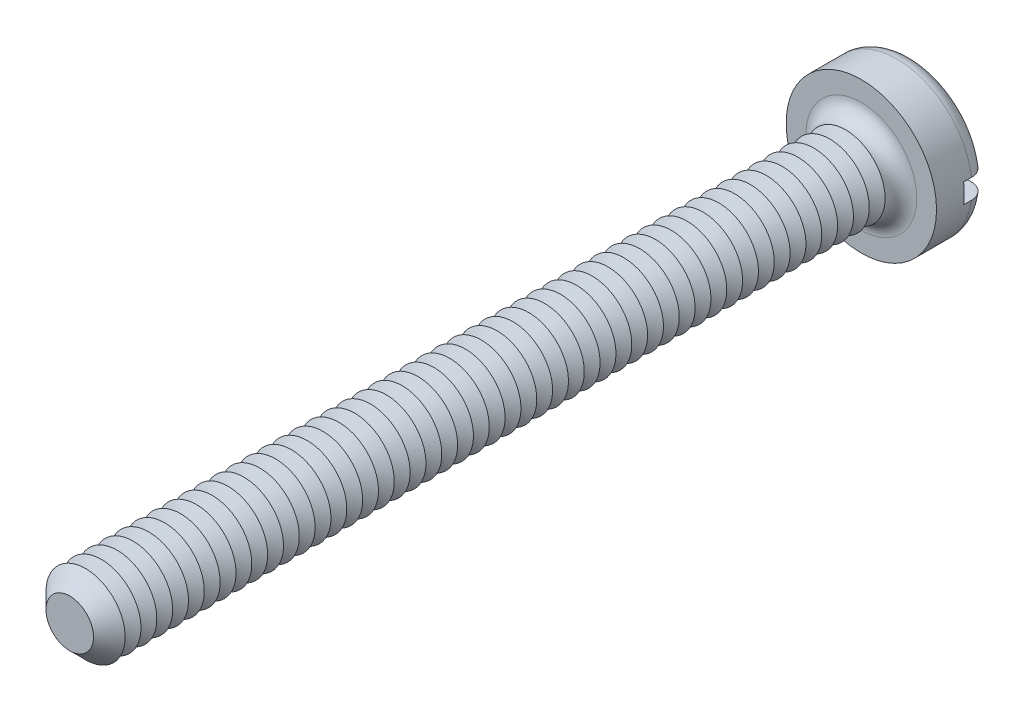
ISO-10303-21;
HEADER;
FILE_DESCRIPTION(('STEP AP214'),'2;1');
FILE_NAME('part.step','',(''),(''),'','','');
FILE_SCHEMA(('AUTOMOTIVE_DESIGN { 1 0 10303 214 1 1 1 1 }'));
ENDSEC;
DATA;
#1=APPLICATION_CONTEXT('core data for automotive mechanical design processes');
#2=APPLICATION_PROTOCOL_DEFINITION('international standard','automotive_design',2000,#1);
#3=PRODUCT_CONTEXT('',#1,'mechanical');
#4=PRODUCT('Part','Part','',(#3));
#5=PRODUCT_RELATED_PRODUCT_CATEGORY('part','',(#4));
#6=PRODUCT_DEFINITION_FORMATION('','',#4);
#7=PRODUCT_DEFINITION_CONTEXT('part definition',#1,'design');
#8=PRODUCT_DEFINITION('design','',#6,#7);
#9=PRODUCT_DEFINITION_SHAPE('','',#8);
#10=(LENGTH_UNIT() NAMED_UNIT(*) SI_UNIT(.MILLI.,.METRE.));
#11=(NAMED_UNIT(*) PLANE_ANGLE_UNIT() SI_UNIT($,.RADIAN.));
#12=(NAMED_UNIT(*) SI_UNIT($,.STERADIAN.) SOLID_ANGLE_UNIT());
#13=UNCERTAINTY_MEASURE_WITH_UNIT(LENGTH_MEASURE(1.E-05),#10,'distance_accuracy_value','');
#14=(GEOMETRIC_REPRESENTATION_CONTEXT(3) GLOBAL_UNCERTAINTY_ASSIGNED_CONTEXT((#13)) GLOBAL_UNIT_ASSIGNED_CONTEXT((#10,
#11,#12)) REPRESENTATION_CONTEXT('',''));
#15=CARTESIAN_POINT('',(0.,0.,0.));
#16=DIRECTION('',(0.,0.,1.));
#17=DIRECTION('',(1.,0.,0.));
#18=AXIS2_PLACEMENT_3D('',#15,#16,#17);
#19=CARTESIAN_POINT('',(0.,0.,-1.3));
#20=DIRECTION('',(0.,0.,1.));
#21=DIRECTION('',(1.,0.,0.));
#22=AXIS2_PLACEMENT_3D('',#19,#20,#21);
#23=PLANE('',#22);
#24=CARTESIAN_POINT('',(0.,0.,-1.3));
#25=DIRECTION('',(0.,0.,1.));
#26=DIRECTION('',(1.,0.,0.));
#27=AXIS2_PLACEMENT_3D('',#24,#25,#26);
#28=CIRCLE('',#27,1.5);
#29=CARTESIAN_POINT('',(-1.4790199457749,0.25,-1.3));
#30=VERTEX_POINT('',#29);
#31=CARTESIAN_POINT('',(1.4790199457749,0.25,-1.3));
#32=VERTEX_POINT('',#31);
#33=EDGE_CURVE('E116',#30,#32,#28,.F.);
#34=ORIENTED_EDGE('',*,*,#33,.T.);
#35=DIRECTION('',(1.,0.,0.));
#36=VECTOR('',#35,1.);
#37=CARTESIAN_POINT('',(-1.9,0.25,-1.3));
#38=LINE('',#37,#36);
#39=EDGE_CURVE('E111',#30,#32,#38,.T.);
#40=ORIENTED_EDGE('',*,*,#39,.F.);
#41=EDGE_LOOP('',(#34,#40));
#42=FACE_BOUND('',#41,.T.);
#43=ADVANCED_FACE('F39',(#42),#23,.F.);
#44=CARTESIAN_POINT('',(0.,0.,-0.9));
#45=DIRECTION('',(0.,0.,1.));
#46=DIRECTION('',(1.,0.,0.));
#47=AXIS2_PLACEMENT_3D('',#44,#45,#46);
#48=TOROIDAL_SURFACE('',#47,1.5,0.4);
#49=CARTESIAN_POINT('',(-1.8150392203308,0.25,-1.12284384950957));
#50=CARTESIAN_POINT('',(-1.80236980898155,0.25,-1.14155059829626));
#51=CARTESIAN_POINT('',(-1.78809920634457,0.25,-1.15919399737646));
#52=CARTESIAN_POINT('',(-1.75677844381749,0.25,-1.19184073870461));
#53=CARTESIAN_POINT('',(-1.73972468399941,0.25,-1.20684060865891));
#54=CARTESIAN_POINT('',(-1.70336024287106,0.25,-1.23375848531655));
#55=CARTESIAN_POINT('',(-1.68405164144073,0.25,-1.24567930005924));
#56=CARTESIAN_POINT('',(-1.64372549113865,0.25,-1.26613528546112));
#57=CARTESIAN_POINT('',(-1.6227083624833,0.25,-1.27467128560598));
#58=CARTESIAN_POINT('',(-1.57937988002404,0.25,-1.2881995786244));
#59=CARTESIAN_POINT('',(-1.55705957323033,0.25,-1.29316318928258));
#60=CARTESIAN_POINT('',(-1.51190394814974,0.25,-1.29931753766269));
#61=CARTESIAN_POINT('',(-1.48906857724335,0.25,-1.3005078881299));
#62=CARTESIAN_POINT('',(-1.4432641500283,0.25,-1.29909058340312));
#63=CARTESIAN_POINT('',(-1.42029638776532,0.25,-1.29644099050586));
#64=CARTESIAN_POINT('',(-1.37512297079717,0.25,-1.28735146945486));
#65=CARTESIAN_POINT('',(-1.3529173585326,0.25,-1.28091133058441));
#66=CARTESIAN_POINT('',(-1.30974098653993,0.25,-1.26436295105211));
#67=CARTESIAN_POINT('',(-1.28877978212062,0.25,-1.25422975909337));
#68=CARTESIAN_POINT('',(-1.24886205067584,0.25,-1.23057736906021));
#69=CARTESIAN_POINT('',(-1.22990554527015,0.25,-1.21705813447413));
#70=CARTESIAN_POINT('',(-1.19461911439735,0.25,-1.18704970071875));
#71=CARTESIAN_POINT('',(-1.17828051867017,0.25,-1.17057070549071));
#72=CARTESIAN_POINT('',(-1.14865897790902,0.25,-1.13506201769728));
#73=CARTESIAN_POINT('',(-1.13537576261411,0.25,-1.11603255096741));
#74=CARTESIAN_POINT('',(-1.11249827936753,0.25,-1.07630328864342));
#75=CARTESIAN_POINT('',(-1.10284494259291,0.25,-1.05563752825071));
#76=CARTESIAN_POINT('',(-1.08724024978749,0.25,-1.01295282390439));
#77=CARTESIAN_POINT('',(-1.08128829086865,0.25,-0.990934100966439));
#78=CARTESIAN_POINT('',(-1.07339124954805,0.25,-0.946722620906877));
#79=CARTESIAN_POINT('',(-1.07135558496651,0.25,-0.924546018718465));
#80=CARTESIAN_POINT('',(-1.07108722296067,0.25,-0.880170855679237));
#81=CARTESIAN_POINT('',(-1.07285419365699,0.25,-0.857972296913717));
#82=CARTESIAN_POINT('',(-1.0800838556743,0.25,-0.814463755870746));
#83=CARTESIAN_POINT('',(-1.08550159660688,0.25,-0.793146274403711));
#84=CARTESIAN_POINT('',(-1.09980522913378,0.25,-0.751709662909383));
#85=CARTESIAN_POINT('',(-1.10869126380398,0.25,-0.731590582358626));
#86=CARTESIAN_POINT('',(-1.12975121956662,0.25,-0.692901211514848));
#87=CARTESIAN_POINT('',(-1.14195627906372,0.25,-0.674347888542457));
#88=CARTESIAN_POINT('',(-1.1692428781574,0.25,-0.639494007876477));
#89=CARTESIAN_POINT('',(-1.18432473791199,0.25,-0.623193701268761));
#90=CARTESIAN_POINT('',(-1.21730350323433,0.25,-0.592916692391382));
#91=CARTESIAN_POINT('',(-1.23525650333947,0.25,-0.579001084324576));
#92=CARTESIAN_POINT('',(-1.27320799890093,0.25,-0.554314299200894));
#93=CARTESIAN_POINT('',(-1.2932067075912,0.25,-0.543543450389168));
#94=CARTESIAN_POINT('',(-1.33509120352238,0.25,-0.525253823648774));
#95=CARTESIAN_POINT('',(-1.35700545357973,0.25,-0.517800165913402));
#96=CARTESIAN_POINT('',(-1.401770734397,0.25,-0.506652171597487));
#97=CARTESIAN_POINT('',(-1.42462180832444,0.25,-0.502958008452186));
#98=CARTESIAN_POINT('',(-1.4707602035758,0.25,-0.499429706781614));
#99=CARTESIAN_POINT('',(-1.49404932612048,0.25,-0.499619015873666));
#100=CARTESIAN_POINT('',(-1.54026206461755,0.25,-0.50392615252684));
#101=CARTESIAN_POINT('',(-1.56318568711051,0.25,-0.508043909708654));
#102=CARTESIAN_POINT('',(-1.60788420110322,0.25,-0.520077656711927));
#103=CARTESIAN_POINT('',(-1.6296645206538,0.25,-0.527973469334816));
#104=CARTESIAN_POINT('',(-1.67156889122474,0.25,-0.547348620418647));
#105=CARTESIAN_POINT('',(-1.69169302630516,0.25,-0.558827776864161));
#106=CARTESIAN_POINT('',(-1.72948251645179,0.25,-0.584913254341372));
#107=CARTESIAN_POINT('',(-1.74717189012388,0.25,-0.599484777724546));
#108=CARTESIAN_POINT('',(-1.77981909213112,0.25,-0.63142070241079));
#109=CARTESIAN_POINT('',(-1.79477707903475,0.25,-0.648784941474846));
#110=CARTESIAN_POINT('',(-1.82136524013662,0.25,-0.685607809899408));
#111=CARTESIAN_POINT('',(-1.83303003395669,0.25,-0.705041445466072));
#112=CARTESIAN_POINT('',(-1.85289960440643,0.25,-0.745602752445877));
#113=CARTESIAN_POINT('',(-1.86110468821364,0.25,-0.76673027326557));
#114=CARTESIAN_POINT('',(-1.87375648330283,0.25,-0.809891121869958));
#115=CARTESIAN_POINT('',(-1.87823381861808,0.25,-0.831915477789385));
#116=CARTESIAN_POINT('',(-1.88341152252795,0.25,-0.87640983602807));
#117=CARTESIAN_POINT('',(-1.88411103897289,0.25,-0.898879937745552));
#118=CARTESIAN_POINT('',(-1.88171559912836,0.25,-0.943534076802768));
#119=CARTESIAN_POINT('',(-1.87863413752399,0.25,-0.965718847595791));
#120=CARTESIAN_POINT('',(-1.86879153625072,0.25,-1.00923650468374));
#121=CARTESIAN_POINT('',(-1.86203494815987,0.25,-1.03057040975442));
#122=CARTESIAN_POINT('',(-1.84837477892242,0.25,-1.06373797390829));
#123=CARTESIAN_POINT('',(-1.84255723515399,0.25,-1.07603047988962));
#124=CARTESIAN_POINT('',(-1.82969924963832,0.25,-1.09995814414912));
#125=CARTESIAN_POINT('',(-1.82265881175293,0.25,-1.11159330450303));
#126=CARTESIAN_POINT('',(-1.8150392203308,0.25,-1.12284384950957));
#127=B_SPLINE_CURVE_WITH_KNOTS('',3,(#49,#50,#51,#52,#53,#54,#55,#56,#57,#58,#59,#60,#61,#62,
#63,#64,#65,#66,#67,#68,#69,#70,#71,#72,#73,#74,#75,#76,#77,#78,#79,#80,#81,#82,#83,#84,#85,#86,
#87,#88,#89,#90,#91,#92,#93,#94,#95,#96,#97,#98,#99,#100,#101,#102,#103,#104,#105,#106,#107,
#108,#109,#110,#111,#112,#113,#114,#115,#116,#117,#118,#119,#120,#121,#122,#123,#124,#125,#126),
.UNSPECIFIED.,.T.,.F.,(4,2,2,2,2,2,2,2,2,2,2,2,2,2,2,2,2,2,2,2,2,2,2,2,2,2,2,2,2,2,2,2,2,2,2,2,
2,2,4),(0.,0.0677296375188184,0.135547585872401,0.203303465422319,0.27104273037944,
0.339319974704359,0.407604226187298,0.47663988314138,0.545679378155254,0.615194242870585,
0.684709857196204,0.753990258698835,0.82326452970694,0.891356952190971,0.959438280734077,
1.02592503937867,1.0924059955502,1.15808300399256,1.2237627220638,1.29008126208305,
1.35640718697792,1.4242376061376,1.49207510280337,1.5611911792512,1.63031044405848,
1.69984715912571,1.76938262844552,1.8385508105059,1.90771547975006,1.97613962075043,
2.04455978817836,2.11223135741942,2.17989691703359,2.24700094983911,2.31412011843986,
2.38100042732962,2.44779809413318,2.48853193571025,2.52926564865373),.UNSPECIFIED.);
#128=CARTESIAN_POINT('',(-1.88348082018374,0.25,-0.9));
#129=VERTEX_POINT('',#128);
#130=EDGE_CURVE('E563',#129,#30,#127,.T.);
#131=ORIENTED_EDGE('',*,*,#130,.F.);
#132=CARTESIAN_POINT('',(0.,0.,-0.9));
#133=DIRECTION('',(0.,0.,1.));
#134=DIRECTION('',(1.,0.,0.));
#135=AXIS2_PLACEMENT_3D('',#132,#133,#134);
#136=CIRCLE('',#135,1.9);
#137=CARTESIAN_POINT('',(1.88348082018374,0.25,-0.9));
#138=VERTEX_POINT('',#137);
#139=EDGE_CURVE('E125',#138,#129,#136,.T.);
#140=ORIENTED_EDGE('',*,*,#139,.F.);
#141=CARTESIAN_POINT('',(1.11362660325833,0.25,-1.07710243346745));
#142=CARTESIAN_POINT('',(1.12388366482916,0.25,-1.09736755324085));
#143=CARTESIAN_POINT('',(1.13589127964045,0.25,-1.11676768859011));
#144=CARTESIAN_POINT('',(1.16301945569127,0.25,-1.15328107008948));
#145=CARTESIAN_POINT('',(1.17814463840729,0.25,-1.17039085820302));
#146=CARTESIAN_POINT('',(1.21101661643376,0.25,-1.20182395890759));
#147=CARTESIAN_POINT('',(1.22875976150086,0.25,-1.21615108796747));
#148=CARTESIAN_POINT('',(1.26636392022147,0.25,-1.24166932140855));
#149=CARTESIAN_POINT('',(1.28622436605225,0.25,-1.25286126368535));
#150=CARTESIAN_POINT('',(1.32781377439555,0.25,-1.27196191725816));
#151=CARTESIAN_POINT('',(1.34956550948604,0.25,-1.27982107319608));
#152=CARTESIAN_POINT('',(1.39407620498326,0.25,-1.29180513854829));
#153=CARTESIAN_POINT('',(1.41683526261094,0.25,-1.29592968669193));
#154=CARTESIAN_POINT('',(1.46288034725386,0.25,-1.3003367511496));
#155=CARTESIAN_POINT('',(1.48616890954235,0.25,-1.30059287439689));
#156=CARTESIAN_POINT('',(1.53245605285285,0.25,-1.29717239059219));
#157=CARTESIAN_POINT('',(1.55545463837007,0.25,-1.29349584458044));
#158=CARTESIAN_POINT('',(1.60038828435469,0.25,-1.28232271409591));
#159=CARTESIAN_POINT('',(1.62232790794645,0.25,-1.27484449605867));
#160=CARTESIAN_POINT('',(1.66461970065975,0.25,-1.25627203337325));
#161=CARTESIAN_POINT('',(1.68497195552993,0.25,-1.24517798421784));
#162=CARTESIAN_POINT('',(1.72328060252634,0.25,-1.21981269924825));
#163=CARTESIAN_POINT('',(1.74126001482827,0.25,-1.2055762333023));
#164=CARTESIAN_POINT('',(1.77453973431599,0.25,-1.17425606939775));
#165=CARTESIAN_POINT('',(1.78984019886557,0.25,-1.1571725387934));
#166=CARTESIAN_POINT('',(1.81715014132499,0.25,-1.12084732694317));
#167=CARTESIAN_POINT('',(1.82919410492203,0.25,-1.10163156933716));
#168=CARTESIAN_POINT('',(1.84985315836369,0.25,-1.06143759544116));
#169=CARTESIAN_POINT('',(1.85846842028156,0.25,-1.04045946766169));
#170=CARTESIAN_POINT('',(1.87195437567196,0.25,-0.997526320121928));
#171=CARTESIAN_POINT('',(1.87685590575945,0.25,-0.975580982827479));
#172=CARTESIAN_POINT('',(1.88288741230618,0.25,-0.931178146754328));
#173=CARTESIAN_POINT('',(1.88401750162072,0.25,-0.908720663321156));
#174=CARTESIAN_POINT('',(1.88247598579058,0.25,-0.864033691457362));
#175=CARTESIAN_POINT('',(1.87982069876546,0.25,-0.841803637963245));
#176=CARTESIAN_POINT('',(1.87081646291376,0.25,-0.798104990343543));
#177=CARTESIAN_POINT('',(1.86446754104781,0.25,-0.776636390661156));
#178=CARTESIAN_POINT('',(1.84826063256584,0.25,-0.735060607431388));
#179=CARTESIAN_POINT('',(1.83840161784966,0.25,-0.714953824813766));
#180=CARTESIAN_POINT('',(1.81546327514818,0.25,-0.676670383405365));
#181=CARTESIAN_POINT('',(1.80238389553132,0.25,-0.658493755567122));
#182=CARTESIAN_POINT('',(1.77331327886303,0.25,-0.62448916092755));
#183=CARTESIAN_POINT('',(1.75730833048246,0.25,-0.608672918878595));
#184=CARTESIAN_POINT('',(1.72289038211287,0.25,-0.579924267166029));
#185=CARTESIAN_POINT('',(1.70447729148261,0.25,-0.566991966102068));
#186=CARTESIAN_POINT('',(1.66559643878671,0.25,-0.544254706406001));
#187=CARTESIAN_POINT('',(1.64511218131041,0.25,-0.53447796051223));
#188=CARTESIAN_POINT('',(1.60280554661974,0.25,-0.518459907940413));
#189=CARTESIAN_POINT('',(1.58098309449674,0.25,-0.512218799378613));
#190=CARTESIAN_POINT('',(1.53636184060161,0.25,-0.503375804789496));
#191=CARTESIAN_POINT('',(1.51355490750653,0.25,-0.500814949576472));
#192=CARTESIAN_POINT('',(1.46783245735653,0.25,-0.499516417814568));
#193=CARTESIAN_POINT('',(1.44491693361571,0.25,-0.500778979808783));
#194=CARTESIAN_POINT('',(1.39937748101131,0.25,-0.50711284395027));
#195=CARTESIAN_POINT('',(1.37675897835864,0.25,-0.512223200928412));
#196=CARTESIAN_POINT('',(1.33269286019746,0.25,-0.526151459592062));
#197=CARTESIAN_POINT('',(1.31124530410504,0.25,-0.534969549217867));
#198=CARTESIAN_POINT('',(1.27004097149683,0.25,-0.556118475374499));
#199=CARTESIAN_POINT('',(1.25029179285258,0.25,-0.568464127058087));
#200=CARTESIAN_POINT('',(1.21316554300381,0.25,-0.59631968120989));
#201=CARTESIAN_POINT('',(1.19578844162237,0.25,-0.611829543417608));
#202=CARTESIAN_POINT('',(1.16406059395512,0.25,-0.645459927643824));
#203=CARTESIAN_POINT('',(1.14968747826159,0.25,-0.663559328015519));
#204=CARTESIAN_POINT('',(1.12425968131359,0.25,-0.70195566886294));
#205=CARTESIAN_POINT('',(1.11320445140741,0.25,-0.722252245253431));
#206=CARTESIAN_POINT('',(1.09497726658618,0.25,-0.764020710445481));
#207=CARTESIAN_POINT('',(1.08772970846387,0.25,-0.785459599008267));
#208=CARTESIAN_POINT('',(1.07702618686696,0.25,-0.829269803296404));
#209=CARTESIAN_POINT('',(1.07357062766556,0.25,-0.851641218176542));
#210=CARTESIAN_POINT('',(1.07060826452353,0.25,-0.896160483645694));
#211=CARTESIAN_POINT('',(1.07101876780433,0.25,-0.918302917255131));
#212=CARTESIAN_POINT('',(1.07557730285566,0.25,-0.962179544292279));
#213=CARTESIAN_POINT('',(1.07972048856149,0.25,-0.983914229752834));
#214=CARTESIAN_POINT('',(1.08912066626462,0.25,-1.01754924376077));
#215=CARTESIAN_POINT('',(1.09320341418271,0.25,-1.02979035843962));
#216=CARTESIAN_POINT('',(1.10254493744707,0.25,-1.05381470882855));
#217=CARTESIAN_POINT('',(1.10780368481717,0.25,-1.06559795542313));
#218=CARTESIAN_POINT('',(1.11362660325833,0.25,-1.07710243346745));
#219=B_SPLINE_CURVE_WITH_KNOTS('',3,(#141,#142,#143,#144,#145,#146,#147,#148,#149,#150,#151,
#152,#153,#154,#155,#156,#157,#158,#159,#160,#161,#162,#163,#164,#165,#166,#167,#168,#169,#170,
#171,#172,#173,#174,#175,#176,#177,#178,#179,#180,#181,#182,#183,#184,#185,#186,#187,#188,#189,
#190,#191,#192,#193,#194,#195,#196,#197,#198,#199,#200,#201,#202,#203,#204,#205,#206,#207,#208,
#209,#210,#211,#212,#213,#214,#215,#216,#217,#218),.UNSPECIFIED.,.T.,.F.,(4,2,2,2,2,2,2,2,2,2,2,
2,2,2,2,2,2,2,2,2,2,2,2,2,2,2,2,2,2,2,2,2,2,2,2,2,2,2,4),(0.,0.0680907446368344,
0.136283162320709,0.204381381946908,0.272461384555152,0.341520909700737,0.410587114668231,
0.480124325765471,0.549660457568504,0.618863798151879,0.688063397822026,0.756532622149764,
0.824997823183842,0.892706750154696,0.960412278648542,1.02754926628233,1.09468424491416,
1.16153068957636,1.22837664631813,1.29524219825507,1.36210882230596,1.42929726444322,
1.49648823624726,1.56426429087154,1.63204414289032,1.70057395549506,1.76910804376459,
1.83834728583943,1.90759003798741,1.97712798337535,2.0466650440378,2.11566422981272,
2.18465199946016,2.25221259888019,2.3197804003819,2.38590630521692,2.45194648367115,
2.49060241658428,2.5292574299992),.UNSPECIFIED.);
#220=EDGE_CURVE('E565',#32,#138,#219,.T.);
#221=ORIENTED_EDGE('',*,*,#220,.F.);
#222=ORIENTED_EDGE('',*,*,#33,.F.);
#223=EDGE_LOOP('',(#131,#140,#221,#222));
#224=FACE_BOUND('',#223,.T.);
#225=ADVANCED_FACE('F547',(#224),#48,.T.);
#226=CARTESIAN_POINT('',(0.,0.,-1.3));
#227=DIRECTION('',(0.,0.,1.));
#228=DIRECTION('',(1.,0.,0.));
#229=AXIS2_PLACEMENT_3D('',#226,#227,#228);
#230=CYLINDRICAL_SURFACE('',#229,1.9);
#231=DIRECTION('',(0.,0.,1.));
#232=VECTOR('',#231,1.);
#233=CARTESIAN_POINT('',(1.88348082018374,0.25,-1.3));
#234=LINE('',#233,#232);
#235=CARTESIAN_POINT('',(1.88348082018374,0.25,-0.7));
#236=VERTEX_POINT('',#235);
#237=EDGE_CURVE('E581',#138,#236,#234,.T.);
#238=ORIENTED_EDGE('',*,*,#237,.F.);
#239=ORIENTED_EDGE('',*,*,#139,.T.);
#240=DIRECTION('',(0.,0.,1.));
#241=VECTOR('',#240,1.);
#242=CARTESIAN_POINT('',(-1.88348082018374,0.25,-1.3));
#243=LINE('',#242,#241);
#244=CARTESIAN_POINT('',(-1.88348082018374,0.25,-0.7));
#245=VERTEX_POINT('',#244);
#246=EDGE_CURVE('E63',#245,#129,#243,.F.);
#247=ORIENTED_EDGE('',*,*,#246,.F.);
#248=CARTESIAN_POINT('',(0.,0.,-0.7));
#249=DIRECTION('',(0.,0.,-1.));
#250=DIRECTION('',(-1.,0.,0.));
#251=AXIS2_PLACEMENT_3D('',#248,#249,#250);
#252=CIRCLE('',#251,1.9);
#253=CARTESIAN_POINT('',(-1.88348082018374,-0.25,-0.7));
#254=VERTEX_POINT('',#253);
#255=EDGE_CURVE('E43',#245,#254,#252,.F.);
#256=ORIENTED_EDGE('',*,*,#255,.T.);
#257=DIRECTION('',(0.,0.,1.));
#258=VECTOR('',#257,1.);
#259=CARTESIAN_POINT('',(-1.88348082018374,-0.25,-1.3));
#260=LINE('',#259,#258);
#261=CARTESIAN_POINT('',(-1.88348082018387,-0.25,-0.899999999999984));
#262=VERTEX_POINT('',#261);
#263=EDGE_CURVE('E578',#262,#254,#260,.T.);
#264=ORIENTED_EDGE('',*,*,#263,.F.);
#265=CARTESIAN_POINT('',(1.88348082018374,-0.25,-0.9));
#266=VERTEX_POINT('',#265);
#267=EDGE_CURVE('E127',#262,#266,#136,.T.);
#268=ORIENTED_EDGE('',*,*,#267,.T.);
#269=DIRECTION('',(0.,0.,1.));
#270=VECTOR('',#269,1.);
#271=CARTESIAN_POINT('',(1.88348082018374,-0.25,-1.3));
#272=LINE('',#271,#270);
#273=CARTESIAN_POINT('',(1.88348082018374,-0.25,-0.7));
#274=VERTEX_POINT('',#273);
#275=EDGE_CURVE('E55',#274,#266,#272,.F.);
#276=ORIENTED_EDGE('',*,*,#275,.F.);
#277=EDGE_CURVE('E11',#274,#236,#252,.F.);
#278=ORIENTED_EDGE('',*,*,#277,.T.);
#279=EDGE_LOOP('',(#238,#239,#247,#256,#264,#268,#276,#278));
#280=FACE_BOUND('',#279,.T.);
#281=CARTESIAN_POINT('',(0.,0.,0.));
#282=DIRECTION('',(0.,0.,1.));
#283=DIRECTION('',(1.,0.,0.));
#284=AXIS2_PLACEMENT_3D('',#281,#282,#283);
#285=CIRCLE('',#284,1.9);
#286=CARTESIAN_POINT('',(1.9,0.,0.));
#287=VERTEX_POINT('',#286);
#288=EDGE_CURVE('E584',#287,#287,#285,.T.);
#289=ORIENTED_EDGE('',*,*,#288,.F.);
#290=EDGE_LOOP('',(#289));
#291=FACE_BOUND('',#290,.T.);
#292=ADVANCED_FACE('F543',(#280,#291),#230,.T.);
#293=CARTESIAN_POINT('',(1.4790199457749,-0.25,-1.3));
#294=VERTEX_POINT('',#293);
#295=CARTESIAN_POINT('',(-1.4790199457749,-0.25,-1.3));
#296=VERTEX_POINT('',#295);
#297=EDGE_CURVE('E109',#294,#296,#28,.F.);
#298=ORIENTED_EDGE('',*,*,#297,.T.);
#299=DIRECTION('',(-1.,0.,0.));
#300=VECTOR('',#299,1.);
#301=CARTESIAN_POINT('',(-1.9,-0.25,-1.3));
#302=LINE('',#301,#300);
#303=EDGE_CURVE('E96',#294,#296,#302,.T.);
#304=ORIENTED_EDGE('',*,*,#303,.F.);
#305=EDGE_LOOP('',(#298,#304));
#306=FACE_BOUND('',#305,.T.);
#307=ADVANCED_FACE('F108',(#306),#23,.F.);
#308=CARTESIAN_POINT('',(0.,0.,0.));
#309=DIRECTION('',(0.,0.,1.));
#310=DIRECTION('',(1.,0.,0.));
#311=AXIS2_PLACEMENT_3D('',#308,#309,#310);
#312=PLANE('',#311);
#313=CARTESIAN_POINT('',(0.,0.,0.));
#314=DIRECTION('',(0.,0.,1.));
#315=DIRECTION('',(1.,0.,0.));
#316=AXIS2_PLACEMENT_3D('',#313,#314,#315);
#317=CIRCLE('',#316,1.4);
#318=CARTESIAN_POINT('',(1.4,0.,0.));
#319=VERTEX_POINT('',#318);
#320=EDGE_CURVE('E115',#319,#319,#317,.F.);
#321=ORIENTED_EDGE('',*,*,#320,.T.);
#322=EDGE_LOOP('',(#321));
#323=FACE_BOUND('',#322,.T.);
#324=ORIENTED_EDGE('',*,*,#288,.T.);
#325=EDGE_LOOP('',(#324));
#326=FACE_BOUND('',#325,.T.);
#327=ADVANCED_FACE('F542',(#323,#326),#312,.T.);
#328=CARTESIAN_POINT('',(-1.8150392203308,-0.25,-1.12284384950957));
#329=CARTESIAN_POINT('',(-1.82756185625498,-0.25,-1.10435021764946));
#330=CARTESIAN_POINT('',(-1.83853807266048,-0.25,-1.08479072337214));
#331=CARTESIAN_POINT('',(-1.85706233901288,-0.25,-1.04409188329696));
#332=CARTESIAN_POINT('',(-1.86460655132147,-0.25,-1.02295079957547));
#333=CARTESIAN_POINT('',(-1.87603074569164,-0.25,-0.979704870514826));
#334=CARTESIAN_POINT('',(-1.87991177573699,-0.25,-0.957600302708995));
#335=CARTESIAN_POINT('',(-1.88389586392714,-0.25,-0.913058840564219));
#336=CARTESIAN_POINT('',(-1.88399981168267,-0.25,-0.890622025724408));
#337=CARTESIAN_POINT('',(-1.88043374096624,-0.25,-0.846104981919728));
#338=CARTESIAN_POINT('',(-1.87677281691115,-0.25,-0.824024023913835));
#339=CARTESIAN_POINT('',(-1.86579880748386,-0.25,-0.780788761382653));
#340=CARTESIAN_POINT('',(-1.85848560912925,-0.25,-0.759634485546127));
#341=CARTESIAN_POINT('',(-1.8404137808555,-0.25,-0.718830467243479));
#342=CARTESIAN_POINT('',(-1.82965205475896,-0.25,-0.699182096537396));
#343=CARTESIAN_POINT('',(-1.80499939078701,-0.25,-0.661958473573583));
#344=CARTESIAN_POINT('',(-1.7911083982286,-0.25,-0.644383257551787));
#345=CARTESIAN_POINT('',(-1.76051564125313,-0.25,-0.611699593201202));
#346=CARTESIAN_POINT('',(-1.74379913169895,-0.25,-0.596604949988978));
#347=CARTESIAN_POINT('',(-1.70808901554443,-0.25,-0.569406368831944));
#348=CARTESIAN_POINT('',(-1.68909532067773,-0.25,-0.557302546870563));
#349=CARTESIAN_POINT('',(-1.64918615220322,-0.25,-0.536307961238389));
#350=CARTESIAN_POINT('',(-1.62825469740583,-0.25,-0.527447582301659));
#351=CARTESIAN_POINT('',(-1.58521203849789,-0.25,-0.513323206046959));
#352=CARTESIAN_POINT('',(-1.5631007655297,-0.25,-0.508059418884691));
#353=CARTESIAN_POINT('',(-1.51806209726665,-0.25,-0.501215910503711));
#354=CARTESIAN_POINT('',(-1.4951283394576,-0.25,-0.499678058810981));
#355=CARTESIAN_POINT('',(-1.4493239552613,-0.25,-0.500434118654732));
#356=CARTESIAN_POINT('',(-1.4264533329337,-0.25,-0.502728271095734));
#357=CARTESIAN_POINT('',(-1.38118643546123,-0.25,-0.511115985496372));
#358=CARTESIAN_POINT('',(-1.35879703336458,-0.25,-0.51724667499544));
#359=CARTESIAN_POINT('',(-1.31535851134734,-0.25,-0.533167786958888));
#360=CARTESIAN_POINT('',(-1.29430945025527,-0.25,-0.542958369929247));
#361=CARTESIAN_POINT('',(-1.25409242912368,-0.25,-0.565968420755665));
#362=CARTESIAN_POINT('',(-1.23493023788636,-0.25,-0.579197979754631));
#363=CARTESIAN_POINT('',(-1.19912477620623,-0.25,-0.608715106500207));
#364=CARTESIAN_POINT('',(-1.18248143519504,-0.25,-0.625002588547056));
#365=CARTESIAN_POINT('',(-1.15237533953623,-0.25,-0.660018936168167));
#366=CARTESIAN_POINT('',(-1.13888343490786,-0.25,-0.678722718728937));
#367=CARTESIAN_POINT('',(-1.115312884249,-0.25,-0.718170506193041));
#368=CARTESIAN_POINT('',(-1.10523377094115,-0.25,-0.738914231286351));
#369=CARTESIAN_POINT('',(-1.08901310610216,-0.25,-0.781372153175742));
#370=CARTESIAN_POINT('',(-1.08279080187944,-0.25,-0.803055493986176));
#371=CARTESIAN_POINT('',(-1.07416105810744,-0.25,-0.847167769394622));
#372=CARTESIAN_POINT('',(-1.07175306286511,-0.25,-0.869596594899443));
#373=CARTESIAN_POINT('',(-1.07084656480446,-0.25,-0.914070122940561));
#374=CARTESIAN_POINT('',(-1.07226874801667,-0.25,-0.936113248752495));
#375=CARTESIAN_POINT('',(-1.07880428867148,-0.25,-0.979644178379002));
#376=CARTESIAN_POINT('',(-1.08391755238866,-0.25,-1.00113199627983));
#377=CARTESIAN_POINT('',(-1.09764616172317,-0.25,-1.04290115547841));
#378=CARTESIAN_POINT('',(-1.10625346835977,-0.25,-1.06318514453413));
#379=CARTESIAN_POINT('',(-1.12669365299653,-0.25,-1.10205584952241));
#380=CARTESIAN_POINT('',(-1.13852679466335,-0.25,-1.12064242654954));
#381=CARTESIAN_POINT('',(-1.16529672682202,-0.25,-1.15594801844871));
#382=CARTESIAN_POINT('',(-1.18028464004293,-0.25,-1.17262825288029));
#383=CARTESIAN_POINT('',(-1.21279183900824,-0.25,-1.20330600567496));
#384=CARTESIAN_POINT('',(-1.23031142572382,-0.25,-1.21730320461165));
#385=CARTESIAN_POINT('',(-1.26781695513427,-0.25,-1.24254670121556));
#386=CARTESIAN_POINT('',(-1.28784999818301,-0.25,-1.25372305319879));
#387=CARTESIAN_POINT('',(-1.3294899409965,-0.25,-1.27260611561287));
#388=CARTESIAN_POINT('',(-1.35109697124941,-0.25,-1.28031253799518));
#389=CARTESIAN_POINT('',(-1.39558575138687,-0.25,-1.29212626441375));
#390=CARTESIAN_POINT('',(-1.4184807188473,-0.25,-1.29618386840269));
#391=CARTESIAN_POINT('',(-1.4646266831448,-0.25,-1.30039947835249));
#392=CARTESIAN_POINT('',(-1.48787767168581,-0.25,-1.30055757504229));
#393=CARTESIAN_POINT('',(-1.53407883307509,-0.25,-1.29695468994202));
#394=CARTESIAN_POINT('',(-1.55702895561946,-0.25,-1.29319306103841));
#395=CARTESIAN_POINT('',(-1.60196718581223,-0.25,-1.28183520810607));
#396=CARTESIAN_POINT('',(-1.62395508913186,-0.25,-1.27423817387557));
#397=CARTESIAN_POINT('',(-1.66614393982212,-0.25,-1.25548646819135));
#398=CARTESIAN_POINT('',(-1.68635782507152,-0.25,-1.24436087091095));
#399=CARTESIAN_POINT('',(-1.72458266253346,-0.25,-1.21884344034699));
#400=CARTESIAN_POINT('',(-1.74259637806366,-0.25,-1.20445577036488));
#401=CARTESIAN_POINT('',(-1.76968989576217,-0.25,-1.1787247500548));
#402=CARTESIAN_POINT('',(-1.77959984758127,-0.25,-1.1682407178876));
#403=CARTESIAN_POINT('',(-1.79823423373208,-0.25,-1.14626700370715));
#404=CARTESIAN_POINT('',(-1.80695867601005,-0.25,-1.1347773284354));
#405=CARTESIAN_POINT('',(-1.8150392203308,-0.25,-1.12284384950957));
#406=B_SPLINE_CURVE_WITH_KNOTS('',3,(#328,#329,#330,#331,#332,#333,#334,#335,#336,#337,#338,
#339,#340,#341,#342,#343,#344,#345,#346,#347,#348,#349,#350,#351,#352,#353,#354,#355,#356,#357,
#358,#359,#360,#361,#362,#363,#364,#365,#366,#367,#368,#369,#370,#371,#372,#373,#374,#375,#376,
#377,#378,#379,#380,#381,#382,#383,#384,#385,#386,#387,#388,#389,#390,#391,#392,#393,#394,#395,
#396,#397,#398,#399,#400,#401,#402,#403,#404,#405),.UNSPECIFIED.,.T.,.F.,(4,2,2,2,2,2,2,2,2,2,2,
2,2,2,2,2,2,2,2,2,2,2,2,2,2,2,2,2,2,2,2,2,2,2,2,2,2,2,4),(0.,0.0669512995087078,
0.133977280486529,0.200984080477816,0.267975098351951,0.334804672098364,0.401636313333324,
0.468528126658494,0.535421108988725,0.602674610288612,0.669930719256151,0.737801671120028,
0.805676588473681,0.87431077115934,0.942949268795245,1.0122625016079,1.08157877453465,
1.15110078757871,1.22062085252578,1.28946987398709,1.35830946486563,1.42565417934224,
1.49298908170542,1.55894041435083,1.62489007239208,1.69068884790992,1.75649300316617,
1.82345932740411,1.89043361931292,1.95893391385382,2.02743989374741,2.09686543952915,
2.16628937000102,2.23572476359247,2.3051748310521,2.3740669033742,2.44287154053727,
2.48607383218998,2.52927583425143),.UNSPECIFIED.);
#407=EDGE_CURVE('E103',#296,#262,#406,.T.);
#408=ORIENTED_EDGE('',*,*,#407,.F.);
#409=ORIENTED_EDGE('',*,*,#297,.F.);
#410=CARTESIAN_POINT('',(1.11362660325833,-0.25,-1.07710243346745));
#411=CARTESIAN_POINT('',(1.10368387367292,-0.25,-1.05745397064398));
#412=CARTESIAN_POINT('',(1.09537204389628,-0.25,-1.0369644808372));
#413=CARTESIAN_POINT('',(1.08229212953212,-0.25,-0.994867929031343));
#414=CARTESIAN_POINT('',(1.07752732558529,-0.25,-0.973259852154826));
#415=CARTESIAN_POINT('',(1.07171197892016,-0.25,-0.929545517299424));
#416=CARTESIAN_POINT('',(1.07066166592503,-0.25,-0.907439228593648));
#417=CARTESIAN_POINT('',(1.07231382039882,-0.25,-0.863372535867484));
#418=CARTESIAN_POINT('',(1.07501551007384,-0.25,-0.841412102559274));
#419=CARTESIAN_POINT('',(1.08404966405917,-0.25,-0.798386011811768));
#420=CARTESIAN_POINT('',(1.09036099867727,-0.25,-0.777315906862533));
#421=CARTESIAN_POINT('',(1.10638973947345,-0.25,-0.736514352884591));
#422=CARTESIAN_POINT('',(1.11610743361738,-0.25,-0.716783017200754));
#423=CARTESIAN_POINT('',(1.13878208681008,-0.25,-0.678952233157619));
#424=CARTESIAN_POINT('',(1.15177705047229,-0.25,-0.660875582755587));
#425=CARTESIAN_POINT('',(1.18055347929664,-0.25,-0.62709692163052));
#426=CARTESIAN_POINT('',(1.19633525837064,-0.25,-0.611395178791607));
#427=CARTESIAN_POINT('',(1.23062926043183,-0.25,-0.582430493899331));
#428=CARTESIAN_POINT('',(1.24919608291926,-0.25,-0.569232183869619));
#429=CARTESIAN_POINT('',(1.28825118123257,-0.25,-0.546076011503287));
#430=CARTESIAN_POINT('',(1.30873964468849,-0.25,-0.536118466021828));
#431=CARTESIAN_POINT('',(1.35144534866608,-0.25,-0.519560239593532));
#432=CARTESIAN_POINT('',(1.3736865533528,-0.25,-0.513021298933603));
#433=CARTESIAN_POINT('',(1.41894945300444,-0.25,-0.503751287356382));
#434=CARTESIAN_POINT('',(1.44197117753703,-0.25,-0.50102036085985));
#435=CARTESIAN_POINT('',(1.48824913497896,-0.25,-0.499449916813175));
#436=CARTESIAN_POINT('',(1.5115059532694,-0.25,-0.500627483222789));
#437=CARTESIAN_POINT('',(1.55748678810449,-0.25,-0.506895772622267));
#438=CARTESIAN_POINT('',(1.58021081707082,-0.25,-0.511986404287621));
#439=CARTESIAN_POINT('',(1.6243247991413,-0.25,-0.525910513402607));
#440=CARTESIAN_POINT('',(1.64572225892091,-0.25,-0.534720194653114));
#441=CARTESIAN_POINT('',(1.68671060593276,-0.25,-0.555845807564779));
#442=CARTESIAN_POINT('',(1.70630159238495,-0.25,-0.568161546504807));
#443=CARTESIAN_POINT('',(1.74289060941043,-0.25,-0.595805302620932));
#444=CARTESIAN_POINT('',(1.75991474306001,-0.25,-0.611098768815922));
#445=CARTESIAN_POINT('',(1.79111916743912,-0.25,-0.644354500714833));
#446=CARTESIAN_POINT('',(1.80529962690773,-0.25,-0.662316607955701));
#447=CARTESIAN_POINT('',(1.83025525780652,-0.25,-0.700191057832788));
#448=CARTESIAN_POINT('',(1.84106535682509,-0.25,-0.720080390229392));
#449=CARTESIAN_POINT('',(1.8591630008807,-0.25,-0.761401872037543));
#450=CARTESIAN_POINT('',(1.86645070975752,-0.25,-0.782833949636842));
#451=CARTESIAN_POINT('',(1.87724305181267,-0.25,-0.826454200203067));
#452=CARTESIAN_POINT('',(1.88077646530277,-0.25,-0.848635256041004));
#453=CARTESIAN_POINT('',(1.88405487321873,-0.25,-0.89327539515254));
#454=CARTESIAN_POINT('',(1.88379996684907,-0.25,-0.915734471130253));
#455=CARTESIAN_POINT('',(1.87951702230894,-0.25,-0.96021054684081));
#456=CARTESIAN_POINT('',(1.87550211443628,-0.25,-0.982228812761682));
#457=CARTESIAN_POINT('',(1.86383665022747,-0.25,-1.0252797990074));
#458=CARTESIAN_POINT('',(1.85618610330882,-0.25,-1.04631252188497));
#459=CARTESIAN_POINT('',(1.83746332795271,-0.25,-1.08682395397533));
#460=CARTESIAN_POINT('',(1.82638722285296,-0.25,-1.10630087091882));
#461=CARTESIAN_POINT('',(1.80113946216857,-0.25,-1.14313202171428));
#462=CARTESIAN_POINT('',(1.78696774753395,-0.25,-1.1604862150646));
#463=CARTESIAN_POINT('',(1.75585044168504,-0.25,-1.19268694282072));
#464=CARTESIAN_POINT('',(1.73888979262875,-0.25,-1.20751892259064));
#465=CARTESIAN_POINT('',(1.7027387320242,-0.25,-1.23415579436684));
#466=CARTESIAN_POINT('',(1.68354822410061,-0.25,-1.24596055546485));
#467=CARTESIAN_POINT('',(1.64329341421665,-0.25,-1.26632784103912));
#468=CARTESIAN_POINT('',(1.62221336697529,-0.25,-1.27485924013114));
#469=CARTESIAN_POINT('',(1.5789301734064,-0.25,-1.28830571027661));
#470=CARTESIAN_POINT('',(1.55672695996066,-0.25,-1.29322056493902));
#471=CARTESIAN_POINT('',(1.5115614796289,-0.25,-1.29935191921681));
#472=CARTESIAN_POINT('',(1.4885934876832,-0.25,-1.30052625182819));
#473=CARTESIAN_POINT('',(1.44278240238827,-0.25,-1.2990417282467));
#474=CARTESIAN_POINT('',(1.41993931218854,-0.25,-1.29638277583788));
#475=CARTESIAN_POINT('',(1.37479511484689,-0.25,-1.28727159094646));
#476=CARTESIAN_POINT('',(1.35250125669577,-0.25,-1.2807834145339));
#477=CARTESIAN_POINT('',(1.30930729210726,-0.25,-1.2641644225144));
#478=CARTESIAN_POINT('',(1.2884075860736,-0.25,-1.25403256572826));
#479=CARTESIAN_POINT('',(1.24854853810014,-0.25,-1.23036781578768));
#480=CARTESIAN_POINT('',(1.22959511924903,-0.25,-1.21682495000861));
#481=CARTESIAN_POINT('',(1.19427766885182,-0.25,-1.18672803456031));
#482=CARTESIAN_POINT('',(1.17791048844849,-0.25,-1.170177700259));
#483=CARTESIAN_POINT('',(1.15346856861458,-0.25,-1.14079355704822));
#484=CARTESIAN_POINT('',(1.14449891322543,-0.25,-1.12869247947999));
#485=CARTESIAN_POINT('',(1.12797460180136,-0.25,-1.10355927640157));
#486=CARTESIAN_POINT('',(1.1204199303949,-0.25,-1.09052716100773));
#487=CARTESIAN_POINT('',(1.11362660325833,-0.25,-1.07710243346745));
#488=B_SPLINE_CURVE_WITH_KNOTS('',3,(#410,#411,#412,#413,#414,#415,#416,#417,#418,#419,#420,
#421,#422,#423,#424,#425,#426,#427,#428,#429,#430,#431,#432,#433,#434,#435,#436,#437,#438,#439,
#440,#441,#442,#443,#444,#445,#446,#447,#448,#449,#450,#451,#452,#453,#454,#455,#456,#457,#458,
#459,#460,#461,#462,#463,#464,#465,#466,#467,#468,#469,#470,#471,#472,#473,#474,#475,#476,#477,
#478,#479,#480,#481,#482,#483,#484,#485,#486,#487),.UNSPECIFIED.,.T.,.F.,(4,2,2,2,2,2,2,2,2,2,2,
2,2,2,2,2,2,2,2,2,2,2,2,2,2,2,2,2,2,2,2,2,2,2,2,2,2,2,4),(0.,0.0660089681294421,
0.132078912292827,0.198152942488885,0.26421327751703,0.329890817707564,0.395573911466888,
0.462056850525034,0.528547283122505,0.596571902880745,0.664603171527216,0.733823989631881,
0.803047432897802,0.872573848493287,0.94209864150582,1.01118516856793,1.08026789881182,
1.14859228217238,1.21691261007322,1.28449938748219,1.35208302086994,1.41914473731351,
1.48620469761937,1.55303134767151,1.61985782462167,1.68676020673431,1.75366386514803,
1.82094137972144,1.88822180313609,1.95612699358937,2.0240362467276,2.09270838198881,
2.16138224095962,2.23071121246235,2.30006001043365,2.36961396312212,2.4390825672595,
2.48418340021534,2.52928374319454),.UNSPECIFIED.);
#489=EDGE_CURVE('E92',#266,#294,#488,.T.);
#490=ORIENTED_EDGE('',*,*,#489,.F.);
#491=ORIENTED_EDGE('',*,*,#267,.F.);
#492=EDGE_LOOP('',(#408,#409,#490,#491));
#493=FACE_BOUND('',#492,.T.);
#494=ADVANCED_FACE('F113',(#493),#48,.T.);
#495=CARTESIAN_POINT('',(0.,0.,0.400000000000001));
#496=DIRECTION('',(0.,0.,1.));
#497=DIRECTION('',(1.,0.,0.));
#498=AXIS2_PLACEMENT_3D('',#495,#496,#497);
#499=TOROIDAL_SURFACE('',#498,1.4,0.4);
#500=ORIENTED_EDGE('',*,*,#320,.F.);
#501=EDGE_LOOP('',(#500));
#502=FACE_BOUND('',#501,.T.);
#503=CARTESIAN_POINT('',(0.,0.,0.400000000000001));
#504=DIRECTION('',(0.,0.,-1.));
#505=DIRECTION('',(-1.,0.,0.));
#506=AXIS2_PLACEMENT_3D('',#503,#504,#505);
#507=CIRCLE('',#506,1.);
#508=CARTESIAN_POINT('',(-1.,0.,0.400000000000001));
#509=VERTEX_POINT('',#508);
#510=EDGE_CURVE('E589',#509,#509,#507,.T.);
#511=ORIENTED_EDGE('',*,*,#510,.T.);
#512=EDGE_LOOP('',(#511));
#513=FACE_BOUND('',#512,.T.);
#514=ADVANCED_FACE('F535',(#502,#513),#499,.F.);
#515=CARTESIAN_POINT('',(0.,0.,0.600000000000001));
#516=DIRECTION('',(0.,0.,-1.));
#517=DIRECTION('',(-1.,0.,0.));
#518=AXIS2_PLACEMENT_3D('',#515,#516,#517);
#519=CONICAL_SURFACE('',#518,0.653589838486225,1.0471975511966);
#520=ORIENTED_EDGE('',*,*,#510,.F.);
#521=EDGE_LOOP('',(#520));
#522=FACE_BOUND('',#521,.T.);
#523=CARTESIAN_POINT('',(0.,0.,0.600000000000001));
#524=DIRECTION('',(0.,0.,-1.));
#525=DIRECTION('',(-1.,0.,0.));
#526=AXIS2_PLACEMENT_3D('',#523,#524,#525);
#527=CIRCLE('',#526,0.653589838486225);
#528=CARTESIAN_POINT('',(-0.653589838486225,0.,0.600000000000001));
#529=VERTEX_POINT('',#528);
#530=EDGE_CURVE('E595',#529,#529,#527,.T.);
#531=ORIENTED_EDGE('',*,*,#530,.T.);
#532=EDGE_LOOP('',(#531));
#533=FACE_BOUND('',#532,.T.);
#534=ADVANCED_FACE('F531',(#522,#533),#519,.T.);
#535=CARTESIAN_POINT('',(0.,0.,0.800000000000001));
#536=DIRECTION('',(0.,0.,1.));
#537=DIRECTION('',(1.,0.,0.));
#538=AXIS2_PLACEMENT_3D('',#535,#536,#537);
#539=CONICAL_SURFACE('',#538,1.,1.0471975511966);
#540=ORIENTED_EDGE('',*,*,#530,.F.);
#541=EDGE_LOOP('',(#540));
#542=FACE_BOUND('',#541,.T.);
#543=CARTESIAN_POINT('',(0.,0.,0.800000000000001));
#544=DIRECTION('',(0.,0.,-1.));
#545=DIRECTION('',(-1.,0.,0.));
#546=AXIS2_PLACEMENT_3D('',#543,#544,#545);
#547=CIRCLE('',#546,1.);
#548=CARTESIAN_POINT('',(-1.,0.,0.800000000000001));
#549=VERTEX_POINT('',#548);
#550=EDGE_CURVE('E601',#549,#549,#547,.T.);
#551=ORIENTED_EDGE('',*,*,#550,.T.);
#552=EDGE_LOOP('',(#551));
#553=FACE_BOUND('',#552,.T.);
#554=ADVANCED_FACE('F527',(#542,#553),#539,.T.);
#555=CARTESIAN_POINT('',(0.,0.,1.));
#556=DIRECTION('',(0.,0.,-1.));
#557=DIRECTION('',(-1.,0.,0.));
#558=AXIS2_PLACEMENT_3D('',#555,#556,#557);
#559=CONICAL_SURFACE('',#558,0.653589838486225,1.0471975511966);
#560=ORIENTED_EDGE('',*,*,#550,.F.);
#561=EDGE_LOOP('',(#560));
#562=FACE_BOUND('',#561,.T.);
#563=CARTESIAN_POINT('',(0.,0.,1.));
#564=DIRECTION('',(0.,0.,-1.));
#565=DIRECTION('',(-1.,0.,0.));
#566=AXIS2_PLACEMENT_3D('',#563,#564,#565);
#567=CIRCLE('',#566,0.653589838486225);
#568=CARTESIAN_POINT('',(-0.653589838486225,0.,1.));
#569=VERTEX_POINT('',#568);
#570=EDGE_CURVE('E605',#569,#569,#567,.T.);
#571=ORIENTED_EDGE('',*,*,#570,.T.);
#572=EDGE_LOOP('',(#571));
#573=FACE_BOUND('',#572,.T.);
#574=ADVANCED_FACE('F523',(#562,#573),#559,.T.);
#575=CARTESIAN_POINT('',(0.,0.,1.2));
#576=DIRECTION('',(0.,0.,1.));
#577=DIRECTION('',(1.,0.,0.));
#578=AXIS2_PLACEMENT_3D('',#575,#576,#577);
#579=CONICAL_SURFACE('',#578,1.,1.0471975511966);
#580=ORIENTED_EDGE('',*,*,#570,.F.);
#581=EDGE_LOOP('',(#580));
#582=FACE_BOUND('',#581,.T.);
#583=CARTESIAN_POINT('',(0.,0.,1.2));
#584=DIRECTION('',(0.,0.,-1.));
#585=DIRECTION('',(-1.,0.,0.));
#586=AXIS2_PLACEMENT_3D('',#583,#584,#585);
#587=CIRCLE('',#586,1.);
#588=CARTESIAN_POINT('',(-1.,0.,1.2));
#589=VERTEX_POINT('',#588);
#590=EDGE_CURVE('E608',#589,#589,#587,.T.);
#591=ORIENTED_EDGE('',*,*,#590,.T.);
#592=EDGE_LOOP('',(#591));
#593=FACE_BOUND('',#592,.T.);
#594=ADVANCED_FACE('F519',(#582,#593),#579,.T.);
#595=CARTESIAN_POINT('',(0.,0.,1.4));
#596=DIRECTION('',(0.,0.,-1.));
#597=DIRECTION('',(-1.,0.,0.));
#598=AXIS2_PLACEMENT_3D('',#595,#596,#597);
#599=CONICAL_SURFACE('',#598,0.653589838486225,1.0471975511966);
#600=ORIENTED_EDGE('',*,*,#590,.F.);
#601=EDGE_LOOP('',(#600));
#602=FACE_BOUND('',#601,.T.);
#603=CARTESIAN_POINT('',(0.,0.,1.4));
#604=DIRECTION('',(0.,0.,-1.));
#605=DIRECTION('',(-1.,0.,0.));
#606=AXIS2_PLACEMENT_3D('',#603,#604,#605);
#607=CIRCLE('',#606,0.653589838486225);
#608=CARTESIAN_POINT('',(-0.653589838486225,0.,1.4));
#609=VERTEX_POINT('',#608);
#610=EDGE_CURVE('E612',#609,#609,#607,.T.);
#611=ORIENTED_EDGE('',*,*,#610,.T.);
#612=EDGE_LOOP('',(#611));
#613=FACE_BOUND('',#612,.T.);
#614=ADVANCED_FACE('F515',(#602,#613),#599,.T.);
#615=CARTESIAN_POINT('',(0.,0.,1.6));
#616=DIRECTION('',(0.,0.,1.));
#617=DIRECTION('',(1.,0.,0.));
#618=AXIS2_PLACEMENT_3D('',#615,#616,#617);
#619=CONICAL_SURFACE('',#618,1.,1.0471975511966);
#620=ORIENTED_EDGE('',*,*,#610,.F.);
#621=EDGE_LOOP('',(#620));
#622=FACE_BOUND('',#621,.T.);
#623=CARTESIAN_POINT('',(0.,0.,1.6));
#624=DIRECTION('',(0.,0.,-1.));
#625=DIRECTION('',(-1.,0.,0.));
#626=AXIS2_PLACEMENT_3D('',#623,#624,#625);
#627=CIRCLE('',#626,1.);
#628=CARTESIAN_POINT('',(-1.,0.,1.6));
#629=VERTEX_POINT('',#628);
#630=EDGE_CURVE('E616',#629,#629,#627,.T.);
#631=ORIENTED_EDGE('',*,*,#630,.T.);
#632=EDGE_LOOP('',(#631));
#633=FACE_BOUND('',#632,.T.);
#634=ADVANCED_FACE('F511',(#622,#633),#619,.T.);
#635=CARTESIAN_POINT('',(0.,0.,1.8));
#636=DIRECTION('',(0.,0.,-1.));
#637=DIRECTION('',(-1.,0.,0.));
#638=AXIS2_PLACEMENT_3D('',#635,#636,#637);
#639=CONICAL_SURFACE('',#638,0.653589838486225,1.0471975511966);
#640=ORIENTED_EDGE('',*,*,#630,.F.);
#641=EDGE_LOOP('',(#640));
#642=FACE_BOUND('',#641,.T.);
#643=CARTESIAN_POINT('',(0.,0.,1.8));
#644=DIRECTION('',(0.,0.,-1.));
#645=DIRECTION('',(-1.,0.,0.));
#646=AXIS2_PLACEMENT_3D('',#643,#644,#645);
#647=CIRCLE('',#646,0.653589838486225);
#648=CARTESIAN_POINT('',(-0.653589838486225,0.,1.8));
#649=VERTEX_POINT('',#648);
#650=EDGE_CURVE('E620',#649,#649,#647,.T.);
#651=ORIENTED_EDGE('',*,*,#650,.T.);
#652=EDGE_LOOP('',(#651));
#653=FACE_BOUND('',#652,.T.);
#654=ADVANCED_FACE('F507',(#642,#653),#639,.T.);
#655=CARTESIAN_POINT('',(0.,0.,2.));
#656=DIRECTION('',(0.,0.,1.));
#657=DIRECTION('',(1.,0.,0.));
#658=AXIS2_PLACEMENT_3D('',#655,#656,#657);
#659=CONICAL_SURFACE('',#658,1.,1.0471975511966);
#660=ORIENTED_EDGE('',*,*,#650,.F.);
#661=EDGE_LOOP('',(#660));
#662=FACE_BOUND('',#661,.T.);
#663=CARTESIAN_POINT('',(0.,0.,2.));
#664=DIRECTION('',(0.,0.,-1.));
#665=DIRECTION('',(-1.,0.,0.));
#666=AXIS2_PLACEMENT_3D('',#663,#664,#665);
#667=CIRCLE('',#666,1.);
#668=CARTESIAN_POINT('',(-1.,0.,2.));
#669=VERTEX_POINT('',#668);
#670=EDGE_CURVE('E624',#669,#669,#667,.T.);
#671=ORIENTED_EDGE('',*,*,#670,.T.);
#672=EDGE_LOOP('',(#671));
#673=FACE_BOUND('',#672,.T.);
#674=ADVANCED_FACE('F503',(#662,#673),#659,.T.);
#675=CARTESIAN_POINT('',(0.,0.,2.2));
#676=DIRECTION('',(0.,0.,-1.));
#677=DIRECTION('',(-1.,0.,0.));
#678=AXIS2_PLACEMENT_3D('',#675,#676,#677);
#679=CONICAL_SURFACE('',#678,0.653589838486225,1.0471975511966);
#680=ORIENTED_EDGE('',*,*,#670,.F.);
#681=EDGE_LOOP('',(#680));
#682=FACE_BOUND('',#681,.T.);
#683=CARTESIAN_POINT('',(0.,0.,2.2));
#684=DIRECTION('',(0.,0.,-1.));
#685=DIRECTION('',(-1.,0.,0.));
#686=AXIS2_PLACEMENT_3D('',#683,#684,#685);
#687=CIRCLE('',#686,0.653589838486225);
#688=CARTESIAN_POINT('',(-0.653589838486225,0.,2.2));
#689=VERTEX_POINT('',#688);
#690=EDGE_CURVE('E628',#689,#689,#687,.T.);
#691=ORIENTED_EDGE('',*,*,#690,.T.);
#692=EDGE_LOOP('',(#691));
#693=FACE_BOUND('',#692,.T.);
#694=ADVANCED_FACE('F499',(#682,#693),#679,.T.);
#695=CARTESIAN_POINT('',(0.,0.,2.4));
#696=DIRECTION('',(0.,0.,1.));
#697=DIRECTION('',(1.,0.,0.));
#698=AXIS2_PLACEMENT_3D('',#695,#696,#697);
#699=CONICAL_SURFACE('',#698,1.,1.0471975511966);
#700=ORIENTED_EDGE('',*,*,#690,.F.);
#701=EDGE_LOOP('',(#700));
#702=FACE_BOUND('',#701,.T.);
#703=CARTESIAN_POINT('',(0.,0.,2.4));
#704=DIRECTION('',(0.,0.,-1.));
#705=DIRECTION('',(-1.,0.,0.));
#706=AXIS2_PLACEMENT_3D('',#703,#704,#705);
#707=CIRCLE('',#706,1.);
#708=CARTESIAN_POINT('',(-1.,0.,2.4));
#709=VERTEX_POINT('',#708);
#710=EDGE_CURVE('E632',#709,#709,#707,.T.);
#711=ORIENTED_EDGE('',*,*,#710,.T.);
#712=EDGE_LOOP('',(#711));
#713=FACE_BOUND('',#712,.T.);
#714=ADVANCED_FACE('F495',(#702,#713),#699,.T.);
#715=CARTESIAN_POINT('',(0.,0.,2.6));
#716=DIRECTION('',(0.,0.,-1.));
#717=DIRECTION('',(-1.,0.,0.));
#718=AXIS2_PLACEMENT_3D('',#715,#716,#717);
#719=CONICAL_SURFACE('',#718,0.653589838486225,1.0471975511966);
#720=ORIENTED_EDGE('',*,*,#710,.F.);
#721=EDGE_LOOP('',(#720));
#722=FACE_BOUND('',#721,.T.);
#723=CARTESIAN_POINT('',(0.,0.,2.6));
#724=DIRECTION('',(0.,0.,-1.));
#725=DIRECTION('',(-1.,0.,0.));
#726=AXIS2_PLACEMENT_3D('',#723,#724,#725);
#727=CIRCLE('',#726,0.653589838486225);
#728=CARTESIAN_POINT('',(-0.653589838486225,0.,2.6));
#729=VERTEX_POINT('',#728);
#730=EDGE_CURVE('E636',#729,#729,#727,.T.);
#731=ORIENTED_EDGE('',*,*,#730,.T.);
#732=EDGE_LOOP('',(#731));
#733=FACE_BOUND('',#732,.T.);
#734=ADVANCED_FACE('F491',(#722,#733),#719,.T.);
#735=CARTESIAN_POINT('',(0.,0.,2.8));
#736=DIRECTION('',(0.,0.,1.));
#737=DIRECTION('',(1.,0.,0.));
#738=AXIS2_PLACEMENT_3D('',#735,#736,#737);
#739=CONICAL_SURFACE('',#738,1.,1.0471975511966);
#740=ORIENTED_EDGE('',*,*,#730,.F.);
#741=EDGE_LOOP('',(#740));
#742=FACE_BOUND('',#741,.T.);
#743=CARTESIAN_POINT('',(0.,0.,2.8));
#744=DIRECTION('',(0.,0.,-1.));
#745=DIRECTION('',(-1.,0.,0.));
#746=AXIS2_PLACEMENT_3D('',#743,#744,#745);
#747=CIRCLE('',#746,1.);
#748=CARTESIAN_POINT('',(-1.,0.,2.8));
#749=VERTEX_POINT('',#748);
#750=EDGE_CURVE('E640',#749,#749,#747,.T.);
#751=ORIENTED_EDGE('',*,*,#750,.T.);
#752=EDGE_LOOP('',(#751));
#753=FACE_BOUND('',#752,.T.);
#754=ADVANCED_FACE('F487',(#742,#753),#739,.T.);
#755=CARTESIAN_POINT('',(0.,0.,3.));
#756=DIRECTION('',(0.,0.,-1.));
#757=DIRECTION('',(-1.,0.,0.));
#758=AXIS2_PLACEMENT_3D('',#755,#756,#757);
#759=CONICAL_SURFACE('',#758,0.653589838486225,1.0471975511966);
#760=ORIENTED_EDGE('',*,*,#750,.F.);
#761=EDGE_LOOP('',(#760));
#762=FACE_BOUND('',#761,.T.);
#763=CARTESIAN_POINT('',(0.,0.,3.));
#764=DIRECTION('',(0.,0.,-1.));
#765=DIRECTION('',(-1.,0.,0.));
#766=AXIS2_PLACEMENT_3D('',#763,#764,#765);
#767=CIRCLE('',#766,0.653589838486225);
#768=CARTESIAN_POINT('',(-0.653589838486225,0.,3.));
#769=VERTEX_POINT('',#768);
#770=EDGE_CURVE('E643',#769,#769,#767,.T.);
#771=ORIENTED_EDGE('',*,*,#770,.T.);
#772=EDGE_LOOP('',(#771));
#773=FACE_BOUND('',#772,.T.);
#774=ADVANCED_FACE('F483',(#762,#773),#759,.T.);
#775=CARTESIAN_POINT('',(0.,0.,3.2));
#776=DIRECTION('',(0.,0.,1.));
#777=DIRECTION('',(1.,0.,0.));
#778=AXIS2_PLACEMENT_3D('',#775,#776,#777);
#779=CONICAL_SURFACE('',#778,1.,1.0471975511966);
#780=ORIENTED_EDGE('',*,*,#770,.F.);
#781=EDGE_LOOP('',(#780));
#782=FACE_BOUND('',#781,.T.);
#783=CARTESIAN_POINT('',(0.,0.,3.2));
#784=DIRECTION('',(0.,0.,-1.));
#785=DIRECTION('',(-1.,0.,0.));
#786=AXIS2_PLACEMENT_3D('',#783,#784,#785);
#787=CIRCLE('',#786,1.);
#788=CARTESIAN_POINT('',(-1.,0.,3.2));
#789=VERTEX_POINT('',#788);
#790=EDGE_CURVE('E647',#789,#789,#787,.T.);
#791=ORIENTED_EDGE('',*,*,#790,.T.);
#792=EDGE_LOOP('',(#791));
#793=FACE_BOUND('',#792,.T.);
#794=ADVANCED_FACE('F479',(#782,#793),#779,.T.);
#795=CARTESIAN_POINT('',(0.,0.,3.4));
#796=DIRECTION('',(0.,0.,-1.));
#797=DIRECTION('',(-1.,0.,0.));
#798=AXIS2_PLACEMENT_3D('',#795,#796,#797);
#799=CONICAL_SURFACE('',#798,0.653589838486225,1.0471975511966);
#800=ORIENTED_EDGE('',*,*,#790,.F.);
#801=EDGE_LOOP('',(#800));
#802=FACE_BOUND('',#801,.T.);
#803=CARTESIAN_POINT('',(0.,0.,3.4));
#804=DIRECTION('',(0.,0.,-1.));
#805=DIRECTION('',(-1.,0.,0.));
#806=AXIS2_PLACEMENT_3D('',#803,#804,#805);
#807=CIRCLE('',#806,0.653589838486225);
#808=CARTESIAN_POINT('',(-0.653589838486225,0.,3.4));
#809=VERTEX_POINT('',#808);
#810=EDGE_CURVE('E650',#809,#809,#807,.T.);
#811=ORIENTED_EDGE('',*,*,#810,.T.);
#812=EDGE_LOOP('',(#811));
#813=FACE_BOUND('',#812,.T.);
#814=ADVANCED_FACE('F475',(#802,#813),#799,.T.);
#815=CARTESIAN_POINT('',(0.,0.,3.6));
#816=DIRECTION('',(0.,0.,1.));
#817=DIRECTION('',(1.,0.,0.));
#818=AXIS2_PLACEMENT_3D('',#815,#816,#817);
#819=CONICAL_SURFACE('',#818,1.,1.0471975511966);
#820=ORIENTED_EDGE('',*,*,#810,.F.);
#821=EDGE_LOOP('',(#820));
#822=FACE_BOUND('',#821,.T.);
#823=CARTESIAN_POINT('',(0.,0.,3.6));
#824=DIRECTION('',(0.,0.,-1.));
#825=DIRECTION('',(-1.,0.,0.));
#826=AXIS2_PLACEMENT_3D('',#823,#824,#825);
#827=CIRCLE('',#826,1.);
#828=CARTESIAN_POINT('',(-1.,0.,3.6));
#829=VERTEX_POINT('',#828);
#830=EDGE_CURVE('E654',#829,#829,#827,.T.);
#831=ORIENTED_EDGE('',*,*,#830,.T.);
#832=EDGE_LOOP('',(#831));
#833=FACE_BOUND('',#832,.T.);
#834=ADVANCED_FACE('F471',(#822,#833),#819,.T.);
#835=CARTESIAN_POINT('',(0.,0.,3.8));
#836=DIRECTION('',(0.,0.,-1.));
#837=DIRECTION('',(-1.,0.,0.));
#838=AXIS2_PLACEMENT_3D('',#835,#836,#837);
#839=CONICAL_SURFACE('',#838,0.653589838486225,1.0471975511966);
#840=ORIENTED_EDGE('',*,*,#830,.F.);
#841=EDGE_LOOP('',(#840));
#842=FACE_BOUND('',#841,.T.);
#843=CARTESIAN_POINT('',(0.,0.,3.8));
#844=DIRECTION('',(0.,0.,-1.));
#845=DIRECTION('',(-1.,0.,0.));
#846=AXIS2_PLACEMENT_3D('',#843,#844,#845);
#847=CIRCLE('',#846,0.653589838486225);
#848=CARTESIAN_POINT('',(-0.653589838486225,0.,3.8));
#849=VERTEX_POINT('',#848);
#850=EDGE_CURVE('E658',#849,#849,#847,.T.);
#851=ORIENTED_EDGE('',*,*,#850,.T.);
#852=EDGE_LOOP('',(#851));
#853=FACE_BOUND('',#852,.T.);
#854=ADVANCED_FACE('F467',(#842,#853),#839,.T.);
#855=CARTESIAN_POINT('',(0.,0.,4.));
#856=DIRECTION('',(0.,0.,1.));
#857=DIRECTION('',(1.,0.,0.));
#858=AXIS2_PLACEMENT_3D('',#855,#856,#857);
#859=CONICAL_SURFACE('',#858,1.,1.0471975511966);
#860=ORIENTED_EDGE('',*,*,#850,.F.);
#861=EDGE_LOOP('',(#860));
#862=FACE_BOUND('',#861,.T.);
#863=CARTESIAN_POINT('',(0.,0.,4.));
#864=DIRECTION('',(0.,0.,-1.));
#865=DIRECTION('',(-1.,0.,0.));
#866=AXIS2_PLACEMENT_3D('',#863,#864,#865);
#867=CIRCLE('',#866,1.);
#868=CARTESIAN_POINT('',(-1.,0.,4.));
#869=VERTEX_POINT('',#868);
#870=EDGE_CURVE('E662',#869,#869,#867,.T.);
#871=ORIENTED_EDGE('',*,*,#870,.T.);
#872=EDGE_LOOP('',(#871));
#873=FACE_BOUND('',#872,.T.);
#874=ADVANCED_FACE('F463',(#862,#873),#859,.T.);
#875=CARTESIAN_POINT('',(0.,0.,4.2));
#876=DIRECTION('',(0.,0.,-1.));
#877=DIRECTION('',(-1.,0.,0.));
#878=AXIS2_PLACEMENT_3D('',#875,#876,#877);
#879=CONICAL_SURFACE('',#878,0.653589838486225,1.0471975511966);
#880=ORIENTED_EDGE('',*,*,#870,.F.);
#881=EDGE_LOOP('',(#880));
#882=FACE_BOUND('',#881,.T.);
#883=CARTESIAN_POINT('',(0.,0.,4.2));
#884=DIRECTION('',(0.,0.,-1.));
#885=DIRECTION('',(-1.,0.,0.));
#886=AXIS2_PLACEMENT_3D('',#883,#884,#885);
#887=CIRCLE('',#886,0.653589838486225);
#888=CARTESIAN_POINT('',(-0.653589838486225,0.,4.2));
#889=VERTEX_POINT('',#888);
#890=EDGE_CURVE('E666',#889,#889,#887,.T.);
#891=ORIENTED_EDGE('',*,*,#890,.T.);
#892=EDGE_LOOP('',(#891));
#893=FACE_BOUND('',#892,.T.);
#894=ADVANCED_FACE('F459',(#882,#893),#879,.T.);
#895=CARTESIAN_POINT('',(0.,0.,4.4));
#896=DIRECTION('',(0.,0.,1.));
#897=DIRECTION('',(1.,0.,0.));
#898=AXIS2_PLACEMENT_3D('',#895,#896,#897);
#899=CONICAL_SURFACE('',#898,1.,1.0471975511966);
#900=ORIENTED_EDGE('',*,*,#890,.F.);
#901=EDGE_LOOP('',(#900));
#902=FACE_BOUND('',#901,.T.);
#903=CARTESIAN_POINT('',(0.,0.,4.4));
#904=DIRECTION('',(0.,0.,-1.));
#905=DIRECTION('',(-1.,0.,0.));
#906=AXIS2_PLACEMENT_3D('',#903,#904,#905);
#907=CIRCLE('',#906,1.);
#908=CARTESIAN_POINT('',(-1.,0.,4.4));
#909=VERTEX_POINT('',#908);
#910=EDGE_CURVE('E670',#909,#909,#907,.T.);
#911=ORIENTED_EDGE('',*,*,#910,.T.);
#912=EDGE_LOOP('',(#911));
#913=FACE_BOUND('',#912,.T.);
#914=ADVANCED_FACE('F455',(#902,#913),#899,.T.);
#915=CARTESIAN_POINT('',(0.,0.,4.6));
#916=DIRECTION('',(0.,0.,-1.));
#917=DIRECTION('',(-1.,0.,0.));
#918=AXIS2_PLACEMENT_3D('',#915,#916,#917);
#919=CONICAL_SURFACE('',#918,0.653589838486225,1.0471975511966);
#920=ORIENTED_EDGE('',*,*,#910,.F.);
#921=EDGE_LOOP('',(#920));
#922=FACE_BOUND('',#921,.T.);
#923=CARTESIAN_POINT('',(0.,0.,4.6));
#924=DIRECTION('',(0.,0.,-1.));
#925=DIRECTION('',(-1.,0.,0.));
#926=AXIS2_PLACEMENT_3D('',#923,#924,#925);
#927=CIRCLE('',#926,0.653589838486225);
#928=CARTESIAN_POINT('',(-0.653589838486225,0.,4.6));
#929=VERTEX_POINT('',#928);
#930=EDGE_CURVE('E674',#929,#929,#927,.T.);
#931=ORIENTED_EDGE('',*,*,#930,.T.);
#932=EDGE_LOOP('',(#931));
#933=FACE_BOUND('',#932,.T.);
#934=ADVANCED_FACE('F451',(#922,#933),#919,.T.);
#935=CARTESIAN_POINT('',(0.,0.,4.8));
#936=DIRECTION('',(0.,0.,1.));
#937=DIRECTION('',(1.,0.,0.));
#938=AXIS2_PLACEMENT_3D('',#935,#936,#937);
#939=CONICAL_SURFACE('',#938,1.,1.0471975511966);
#940=ORIENTED_EDGE('',*,*,#930,.F.);
#941=EDGE_LOOP('',(#940));
#942=FACE_BOUND('',#941,.T.);
#943=CARTESIAN_POINT('',(0.,0.,4.8));
#944=DIRECTION('',(0.,0.,-1.));
#945=DIRECTION('',(-1.,0.,0.));
#946=AXIS2_PLACEMENT_3D('',#943,#944,#945);
#947=CIRCLE('',#946,1.);
#948=CARTESIAN_POINT('',(-1.,0.,4.8));
#949=VERTEX_POINT('',#948);
#950=EDGE_CURVE('E678',#949,#949,#947,.T.);
#951=ORIENTED_EDGE('',*,*,#950,.T.);
#952=EDGE_LOOP('',(#951));
#953=FACE_BOUND('',#952,.T.);
#954=ADVANCED_FACE('F447',(#942,#953),#939,.T.);
#955=CARTESIAN_POINT('',(0.,0.,5.));
#956=DIRECTION('',(0.,0.,-1.));
#957=DIRECTION('',(-1.,0.,0.));
#958=AXIS2_PLACEMENT_3D('',#955,#956,#957);
#959=CONICAL_SURFACE('',#958,0.653589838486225,1.0471975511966);
#960=ORIENTED_EDGE('',*,*,#950,.F.);
#961=EDGE_LOOP('',(#960));
#962=FACE_BOUND('',#961,.T.);
#963=CARTESIAN_POINT('',(0.,0.,5.));
#964=DIRECTION('',(0.,0.,-1.));
#965=DIRECTION('',(-1.,0.,0.));
#966=AXIS2_PLACEMENT_3D('',#963,#964,#965);
#967=CIRCLE('',#966,0.653589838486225);
#968=CARTESIAN_POINT('',(-0.653589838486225,0.,5.));
#969=VERTEX_POINT('',#968);
#970=EDGE_CURVE('E682',#969,#969,#967,.T.);
#971=ORIENTED_EDGE('',*,*,#970,.T.);
#972=EDGE_LOOP('',(#971));
#973=FACE_BOUND('',#972,.T.);
#974=ADVANCED_FACE('F443',(#962,#973),#959,.T.);
#975=CARTESIAN_POINT('',(0.,0.,5.2));
#976=DIRECTION('',(0.,0.,1.));
#977=DIRECTION('',(1.,0.,0.));
#978=AXIS2_PLACEMENT_3D('',#975,#976,#977);
#979=CONICAL_SURFACE('',#978,1.,1.0471975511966);
#980=ORIENTED_EDGE('',*,*,#970,.F.);
#981=EDGE_LOOP('',(#980));
#982=FACE_BOUND('',#981,.T.);
#983=CARTESIAN_POINT('',(0.,0.,5.2));
#984=DIRECTION('',(0.,0.,-1.));
#985=DIRECTION('',(-1.,0.,0.));
#986=AXIS2_PLACEMENT_3D('',#983,#984,#985);
#987=CIRCLE('',#986,1.);
#988=CARTESIAN_POINT('',(-1.,0.,5.2));
#989=VERTEX_POINT('',#988);
#990=EDGE_CURVE('E686',#989,#989,#987,.T.);
#991=ORIENTED_EDGE('',*,*,#990,.T.);
#992=EDGE_LOOP('',(#991));
#993=FACE_BOUND('',#992,.T.);
#994=ADVANCED_FACE('F439',(#982,#993),#979,.T.);
#995=CARTESIAN_POINT('',(0.,0.,5.4));
#996=DIRECTION('',(0.,0.,-1.));
#997=DIRECTION('',(-1.,0.,0.));
#998=AXIS2_PLACEMENT_3D('',#995,#996,#997);
#999=CONICAL_SURFACE('',#998,0.653589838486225,1.0471975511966);
#1000=ORIENTED_EDGE('',*,*,#990,.F.);
#1001=EDGE_LOOP('',(#1000));
#1002=FACE_BOUND('',#1001,.T.);
#1003=CARTESIAN_POINT('',(0.,0.,5.4));
#1004=DIRECTION('',(0.,0.,-1.));
#1005=DIRECTION('',(-1.,0.,0.));
#1006=AXIS2_PLACEMENT_3D('',#1003,#1004,#1005);
#1007=CIRCLE('',#1006,0.653589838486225);
#1008=CARTESIAN_POINT('',(-0.653589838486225,0.,5.4));
#1009=VERTEX_POINT('',#1008);
#1010=EDGE_CURVE('E690',#1009,#1009,#1007,.T.);
#1011=ORIENTED_EDGE('',*,*,#1010,.T.);
#1012=EDGE_LOOP('',(#1011));
#1013=FACE_BOUND('',#1012,.T.);
#1014=ADVANCED_FACE('F435',(#1002,#1013),#999,.T.);
#1015=CARTESIAN_POINT('',(0.,0.,5.6));
#1016=DIRECTION('',(0.,0.,1.));
#1017=DIRECTION('',(1.,0.,0.));
#1018=AXIS2_PLACEMENT_3D('',#1015,#1016,#1017);
#1019=CONICAL_SURFACE('',#1018,1.,1.0471975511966);
#1020=ORIENTED_EDGE('',*,*,#1010,.F.);
#1021=EDGE_LOOP('',(#1020));
#1022=FACE_BOUND('',#1021,.T.);
#1023=CARTESIAN_POINT('',(0.,0.,5.6));
#1024=DIRECTION('',(0.,0.,-1.));
#1025=DIRECTION('',(-1.,0.,0.));
#1026=AXIS2_PLACEMENT_3D('',#1023,#1024,#1025);
#1027=CIRCLE('',#1026,1.);
#1028=CARTESIAN_POINT('',(-1.,0.,5.6));
#1029=VERTEX_POINT('',#1028);
#1030=EDGE_CURVE('E694',#1029,#1029,#1027,.T.);
#1031=ORIENTED_EDGE('',*,*,#1030,.T.);
#1032=EDGE_LOOP('',(#1031));
#1033=FACE_BOUND('',#1032,.T.);
#1034=ADVANCED_FACE('F431',(#1022,#1033),#1019,.T.);
#1035=CARTESIAN_POINT('',(0.,0.,5.8));
#1036=DIRECTION('',(0.,0.,-1.));
#1037=DIRECTION('',(-1.,0.,0.));
#1038=AXIS2_PLACEMENT_3D('',#1035,#1036,#1037);
#1039=CONICAL_SURFACE('',#1038,0.653589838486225,1.0471975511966);
#1040=ORIENTED_EDGE('',*,*,#1030,.F.);
#1041=EDGE_LOOP('',(#1040));
#1042=FACE_BOUND('',#1041,.T.);
#1043=CARTESIAN_POINT('',(0.,0.,5.8));
#1044=DIRECTION('',(0.,0.,-1.));
#1045=DIRECTION('',(-1.,0.,0.));
#1046=AXIS2_PLACEMENT_3D('',#1043,#1044,#1045);
#1047=CIRCLE('',#1046,0.653589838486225);
#1048=CARTESIAN_POINT('',(-0.653589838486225,0.,5.8));
#1049=VERTEX_POINT('',#1048);
#1050=EDGE_CURVE('E698',#1049,#1049,#1047,.T.);
#1051=ORIENTED_EDGE('',*,*,#1050,.T.);
#1052=EDGE_LOOP('',(#1051));
#1053=FACE_BOUND('',#1052,.T.);
#1054=ADVANCED_FACE('F427',(#1042,#1053),#1039,.T.);
#1055=CARTESIAN_POINT('',(0.,0.,6.));
#1056=DIRECTION('',(0.,0.,1.));
#1057=DIRECTION('',(1.,0.,0.));
#1058=AXIS2_PLACEMENT_3D('',#1055,#1056,#1057);
#1059=CONICAL_SURFACE('',#1058,1.,1.0471975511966);
#1060=ORIENTED_EDGE('',*,*,#1050,.F.);
#1061=EDGE_LOOP('',(#1060));
#1062=FACE_BOUND('',#1061,.T.);
#1063=CARTESIAN_POINT('',(0.,0.,6.));
#1064=DIRECTION('',(0.,0.,-1.));
#1065=DIRECTION('',(-1.,0.,0.));
#1066=AXIS2_PLACEMENT_3D('',#1063,#1064,#1065);
#1067=CIRCLE('',#1066,1.);
#1068=CARTESIAN_POINT('',(-1.,0.,6.));
#1069=VERTEX_POINT('',#1068);
#1070=EDGE_CURVE('E702',#1069,#1069,#1067,.T.);
#1071=ORIENTED_EDGE('',*,*,#1070,.T.);
#1072=EDGE_LOOP('',(#1071));
#1073=FACE_BOUND('',#1072,.T.);
#1074=ADVANCED_FACE('F423',(#1062,#1073),#1059,.T.);
#1075=CARTESIAN_POINT('',(0.,0.,6.2));
#1076=DIRECTION('',(0.,0.,-1.));
#1077=DIRECTION('',(-1.,0.,0.));
#1078=AXIS2_PLACEMENT_3D('',#1075,#1076,#1077);
#1079=CONICAL_SURFACE('',#1078,0.653589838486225,1.0471975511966);
#1080=ORIENTED_EDGE('',*,*,#1070,.F.);
#1081=EDGE_LOOP('',(#1080));
#1082=FACE_BOUND('',#1081,.T.);
#1083=CARTESIAN_POINT('',(0.,0.,6.2));
#1084=DIRECTION('',(0.,0.,-1.));
#1085=DIRECTION('',(-1.,0.,0.));
#1086=AXIS2_PLACEMENT_3D('',#1083,#1084,#1085);
#1087=CIRCLE('',#1086,0.653589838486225);
#1088=CARTESIAN_POINT('',(-0.653589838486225,0.,6.2));
#1089=VERTEX_POINT('',#1088);
#1090=EDGE_CURVE('E706',#1089,#1089,#1087,.T.);
#1091=ORIENTED_EDGE('',*,*,#1090,.T.);
#1092=EDGE_LOOP('',(#1091));
#1093=FACE_BOUND('',#1092,.T.);
#1094=ADVANCED_FACE('F419',(#1082,#1093),#1079,.T.);
#1095=CARTESIAN_POINT('',(0.,0.,6.4));
#1096=DIRECTION('',(0.,0.,1.));
#1097=DIRECTION('',(1.,0.,0.));
#1098=AXIS2_PLACEMENT_3D('',#1095,#1096,#1097);
#1099=CONICAL_SURFACE('',#1098,1.,1.0471975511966);
#1100=ORIENTED_EDGE('',*,*,#1090,.F.);
#1101=EDGE_LOOP('',(#1100));
#1102=FACE_BOUND('',#1101,.T.);
#1103=CARTESIAN_POINT('',(0.,0.,6.4));
#1104=DIRECTION('',(0.,0.,-1.));
#1105=DIRECTION('',(-1.,0.,0.));
#1106=AXIS2_PLACEMENT_3D('',#1103,#1104,#1105);
#1107=CIRCLE('',#1106,1.);
#1108=CARTESIAN_POINT('',(-1.,0.,6.4));
#1109=VERTEX_POINT('',#1108);
#1110=EDGE_CURVE('E710',#1109,#1109,#1107,.T.);
#1111=ORIENTED_EDGE('',*,*,#1110,.T.);
#1112=EDGE_LOOP('',(#1111));
#1113=FACE_BOUND('',#1112,.T.);
#1114=ADVANCED_FACE('F415',(#1102,#1113),#1099,.T.);
#1115=CARTESIAN_POINT('',(0.,0.,6.6));
#1116=DIRECTION('',(0.,0.,-1.));
#1117=DIRECTION('',(-1.,0.,0.));
#1118=AXIS2_PLACEMENT_3D('',#1115,#1116,#1117);
#1119=CONICAL_SURFACE('',#1118,0.653589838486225,1.0471975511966);
#1120=ORIENTED_EDGE('',*,*,#1110,.F.);
#1121=EDGE_LOOP('',(#1120));
#1122=FACE_BOUND('',#1121,.T.);
#1123=CARTESIAN_POINT('',(0.,0.,6.6));
#1124=DIRECTION('',(0.,0.,-1.));
#1125=DIRECTION('',(-1.,0.,0.));
#1126=AXIS2_PLACEMENT_3D('',#1123,#1124,#1125);
#1127=CIRCLE('',#1126,0.653589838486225);
#1128=CARTESIAN_POINT('',(-0.653589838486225,0.,6.6));
#1129=VERTEX_POINT('',#1128);
#1130=EDGE_CURVE('E713',#1129,#1129,#1127,.T.);
#1131=ORIENTED_EDGE('',*,*,#1130,.T.);
#1132=EDGE_LOOP('',(#1131));
#1133=FACE_BOUND('',#1132,.T.);
#1134=ADVANCED_FACE('F411',(#1122,#1133),#1119,.T.);
#1135=CARTESIAN_POINT('',(0.,0.,6.8));
#1136=DIRECTION('',(0.,0.,1.));
#1137=DIRECTION('',(1.,0.,0.));
#1138=AXIS2_PLACEMENT_3D('',#1135,#1136,#1137);
#1139=CONICAL_SURFACE('',#1138,1.,1.0471975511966);
#1140=ORIENTED_EDGE('',*,*,#1130,.F.);
#1141=EDGE_LOOP('',(#1140));
#1142=FACE_BOUND('',#1141,.T.);
#1143=CARTESIAN_POINT('',(0.,0.,6.8));
#1144=DIRECTION('',(0.,0.,-1.));
#1145=DIRECTION('',(-1.,0.,0.));
#1146=AXIS2_PLACEMENT_3D('',#1143,#1144,#1145);
#1147=CIRCLE('',#1146,1.);
#1148=CARTESIAN_POINT('',(-1.,0.,6.8));
#1149=VERTEX_POINT('',#1148);
#1150=EDGE_CURVE('E717',#1149,#1149,#1147,.T.);
#1151=ORIENTED_EDGE('',*,*,#1150,.T.);
#1152=EDGE_LOOP('',(#1151));
#1153=FACE_BOUND('',#1152,.T.);
#1154=ADVANCED_FACE('F407',(#1142,#1153),#1139,.T.);
#1155=CARTESIAN_POINT('',(0.,0.,7.));
#1156=DIRECTION('',(0.,0.,-1.));
#1157=DIRECTION('',(-1.,0.,0.));
#1158=AXIS2_PLACEMENT_3D('',#1155,#1156,#1157);
#1159=CONICAL_SURFACE('',#1158,0.653589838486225,1.0471975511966);
#1160=ORIENTED_EDGE('',*,*,#1150,.F.);
#1161=EDGE_LOOP('',(#1160));
#1162=FACE_BOUND('',#1161,.T.);
#1163=CARTESIAN_POINT('',(0.,0.,7.));
#1164=DIRECTION('',(0.,0.,-1.));
#1165=DIRECTION('',(-1.,0.,0.));
#1166=AXIS2_PLACEMENT_3D('',#1163,#1164,#1165);
#1167=CIRCLE('',#1166,0.653589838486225);
#1168=CARTESIAN_POINT('',(-0.653589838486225,0.,7.));
#1169=VERTEX_POINT('',#1168);
#1170=EDGE_CURVE('E721',#1169,#1169,#1167,.T.);
#1171=ORIENTED_EDGE('',*,*,#1170,.T.);
#1172=EDGE_LOOP('',(#1171));
#1173=FACE_BOUND('',#1172,.T.);
#1174=ADVANCED_FACE('F403',(#1162,#1173),#1159,.T.);
#1175=CARTESIAN_POINT('',(0.,0.,7.2));
#1176=DIRECTION('',(0.,0.,1.));
#1177=DIRECTION('',(1.,0.,0.));
#1178=AXIS2_PLACEMENT_3D('',#1175,#1176,#1177);
#1179=CONICAL_SURFACE('',#1178,1.,1.0471975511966);
#1180=ORIENTED_EDGE('',*,*,#1170,.F.);
#1181=EDGE_LOOP('',(#1180));
#1182=FACE_BOUND('',#1181,.T.);
#1183=CARTESIAN_POINT('',(0.,0.,7.2));
#1184=DIRECTION('',(0.,0.,-1.));
#1185=DIRECTION('',(-1.,0.,0.));
#1186=AXIS2_PLACEMENT_3D('',#1183,#1184,#1185);
#1187=CIRCLE('',#1186,1.);
#1188=CARTESIAN_POINT('',(-1.,0.,7.2));
#1189=VERTEX_POINT('',#1188);
#1190=EDGE_CURVE('E725',#1189,#1189,#1187,.T.);
#1191=ORIENTED_EDGE('',*,*,#1190,.T.);
#1192=EDGE_LOOP('',(#1191));
#1193=FACE_BOUND('',#1192,.T.);
#1194=ADVANCED_FACE('F399',(#1182,#1193),#1179,.T.);
#1195=CARTESIAN_POINT('',(0.,0.,7.4));
#1196=DIRECTION('',(0.,0.,-1.));
#1197=DIRECTION('',(-1.,0.,0.));
#1198=AXIS2_PLACEMENT_3D('',#1195,#1196,#1197);
#1199=CONICAL_SURFACE('',#1198,0.653589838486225,1.0471975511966);
#1200=ORIENTED_EDGE('',*,*,#1190,.F.);
#1201=EDGE_LOOP('',(#1200));
#1202=FACE_BOUND('',#1201,.T.);
#1203=CARTESIAN_POINT('',(0.,0.,7.4));
#1204=DIRECTION('',(0.,0.,-1.));
#1205=DIRECTION('',(-1.,0.,0.));
#1206=AXIS2_PLACEMENT_3D('',#1203,#1204,#1205);
#1207=CIRCLE('',#1206,0.653589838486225);
#1208=CARTESIAN_POINT('',(-0.653589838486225,0.,7.4));
#1209=VERTEX_POINT('',#1208);
#1210=EDGE_CURVE('E729',#1209,#1209,#1207,.T.);
#1211=ORIENTED_EDGE('',*,*,#1210,.T.);
#1212=EDGE_LOOP('',(#1211));
#1213=FACE_BOUND('',#1212,.T.);
#1214=ADVANCED_FACE('F395',(#1202,#1213),#1199,.T.);
#1215=CARTESIAN_POINT('',(0.,0.,7.6));
#1216=DIRECTION('',(0.,0.,1.));
#1217=DIRECTION('',(1.,0.,0.));
#1218=AXIS2_PLACEMENT_3D('',#1215,#1216,#1217);
#1219=CONICAL_SURFACE('',#1218,1.,1.0471975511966);
#1220=ORIENTED_EDGE('',*,*,#1210,.F.);
#1221=EDGE_LOOP('',(#1220));
#1222=FACE_BOUND('',#1221,.T.);
#1223=CARTESIAN_POINT('',(0.,0.,7.6));
#1224=DIRECTION('',(0.,0.,-1.));
#1225=DIRECTION('',(-1.,0.,0.));
#1226=AXIS2_PLACEMENT_3D('',#1223,#1224,#1225);
#1227=CIRCLE('',#1226,1.);
#1228=CARTESIAN_POINT('',(-1.,0.,7.6));
#1229=VERTEX_POINT('',#1228);
#1230=EDGE_CURVE('E733',#1229,#1229,#1227,.T.);
#1231=ORIENTED_EDGE('',*,*,#1230,.T.);
#1232=EDGE_LOOP('',(#1231));
#1233=FACE_BOUND('',#1232,.T.);
#1234=ADVANCED_FACE('F391',(#1222,#1233),#1219,.T.);
#1235=CARTESIAN_POINT('',(0.,0.,7.8));
#1236=DIRECTION('',(0.,0.,-1.));
#1237=DIRECTION('',(-1.,0.,0.));
#1238=AXIS2_PLACEMENT_3D('',#1235,#1236,#1237);
#1239=CONICAL_SURFACE('',#1238,0.653589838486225,1.0471975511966);
#1240=ORIENTED_EDGE('',*,*,#1230,.F.);
#1241=EDGE_LOOP('',(#1240));
#1242=FACE_BOUND('',#1241,.T.);
#1243=CARTESIAN_POINT('',(0.,0.,7.8));
#1244=DIRECTION('',(0.,0.,-1.));
#1245=DIRECTION('',(-1.,0.,0.));
#1246=AXIS2_PLACEMENT_3D('',#1243,#1244,#1245);
#1247=CIRCLE('',#1246,0.653589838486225);
#1248=CARTESIAN_POINT('',(-0.653589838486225,0.,7.8));
#1249=VERTEX_POINT('',#1248);
#1250=EDGE_CURVE('E737',#1249,#1249,#1247,.T.);
#1251=ORIENTED_EDGE('',*,*,#1250,.T.);
#1252=EDGE_LOOP('',(#1251));
#1253=FACE_BOUND('',#1252,.T.);
#1254=ADVANCED_FACE('F387',(#1242,#1253),#1239,.T.);
#1255=CARTESIAN_POINT('',(0.,0.,8.));
#1256=DIRECTION('',(0.,0.,1.));
#1257=DIRECTION('',(1.,0.,0.));
#1258=AXIS2_PLACEMENT_3D('',#1255,#1256,#1257);
#1259=CONICAL_SURFACE('',#1258,1.,1.0471975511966);
#1260=ORIENTED_EDGE('',*,*,#1250,.F.);
#1261=EDGE_LOOP('',(#1260));
#1262=FACE_BOUND('',#1261,.T.);
#1263=CARTESIAN_POINT('',(0.,0.,8.));
#1264=DIRECTION('',(0.,0.,-1.));
#1265=DIRECTION('',(-1.,0.,0.));
#1266=AXIS2_PLACEMENT_3D('',#1263,#1264,#1265);
#1267=CIRCLE('',#1266,1.);
#1268=CARTESIAN_POINT('',(-1.,0.,8.));
#1269=VERTEX_POINT('',#1268);
#1270=EDGE_CURVE('E741',#1269,#1269,#1267,.T.);
#1271=ORIENTED_EDGE('',*,*,#1270,.T.);
#1272=EDGE_LOOP('',(#1271));
#1273=FACE_BOUND('',#1272,.T.);
#1274=ADVANCED_FACE('F383',(#1262,#1273),#1259,.T.);
#1275=CARTESIAN_POINT('',(0.,0.,8.2));
#1276=DIRECTION('',(0.,0.,-1.));
#1277=DIRECTION('',(-1.,0.,0.));
#1278=AXIS2_PLACEMENT_3D('',#1275,#1276,#1277);
#1279=CONICAL_SURFACE('',#1278,0.653589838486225,1.0471975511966);
#1280=ORIENTED_EDGE('',*,*,#1270,.F.);
#1281=EDGE_LOOP('',(#1280));
#1282=FACE_BOUND('',#1281,.T.);
#1283=CARTESIAN_POINT('',(0.,0.,8.2));
#1284=DIRECTION('',(0.,0.,-1.));
#1285=DIRECTION('',(-1.,0.,0.));
#1286=AXIS2_PLACEMENT_3D('',#1283,#1284,#1285);
#1287=CIRCLE('',#1286,0.653589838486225);
#1288=CARTESIAN_POINT('',(-0.653589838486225,0.,8.2));
#1289=VERTEX_POINT('',#1288);
#1290=EDGE_CURVE('E745',#1289,#1289,#1287,.T.);
#1291=ORIENTED_EDGE('',*,*,#1290,.T.);
#1292=EDGE_LOOP('',(#1291));
#1293=FACE_BOUND('',#1292,.T.);
#1294=ADVANCED_FACE('F379',(#1282,#1293),#1279,.T.);
#1295=CARTESIAN_POINT('',(0.,0.,8.4));
#1296=DIRECTION('',(0.,0.,1.));
#1297=DIRECTION('',(1.,0.,0.));
#1298=AXIS2_PLACEMENT_3D('',#1295,#1296,#1297);
#1299=CONICAL_SURFACE('',#1298,1.,1.0471975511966);
#1300=ORIENTED_EDGE('',*,*,#1290,.F.);
#1301=EDGE_LOOP('',(#1300));
#1302=FACE_BOUND('',#1301,.T.);
#1303=CARTESIAN_POINT('',(0.,0.,8.4));
#1304=DIRECTION('',(0.,0.,-1.));
#1305=DIRECTION('',(-1.,0.,0.));
#1306=AXIS2_PLACEMENT_3D('',#1303,#1304,#1305);
#1307=CIRCLE('',#1306,1.);
#1308=CARTESIAN_POINT('',(-1.,0.,8.4));
#1309=VERTEX_POINT('',#1308);
#1310=EDGE_CURVE('E749',#1309,#1309,#1307,.T.);
#1311=ORIENTED_EDGE('',*,*,#1310,.T.);
#1312=EDGE_LOOP('',(#1311));
#1313=FACE_BOUND('',#1312,.T.);
#1314=ADVANCED_FACE('F375',(#1302,#1313),#1299,.T.);
#1315=CARTESIAN_POINT('',(0.,0.,8.6));
#1316=DIRECTION('',(0.,0.,-1.));
#1317=DIRECTION('',(-1.,0.,0.));
#1318=AXIS2_PLACEMENT_3D('',#1315,#1316,#1317);
#1319=CONICAL_SURFACE('',#1318,0.653589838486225,1.0471975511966);
#1320=ORIENTED_EDGE('',*,*,#1310,.F.);
#1321=EDGE_LOOP('',(#1320));
#1322=FACE_BOUND('',#1321,.T.);
#1323=CARTESIAN_POINT('',(0.,0.,8.6));
#1324=DIRECTION('',(0.,0.,-1.));
#1325=DIRECTION('',(-1.,0.,0.));
#1326=AXIS2_PLACEMENT_3D('',#1323,#1324,#1325);
#1327=CIRCLE('',#1326,0.653589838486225);
#1328=CARTESIAN_POINT('',(-0.653589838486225,0.,8.6));
#1329=VERTEX_POINT('',#1328);
#1330=EDGE_CURVE('E753',#1329,#1329,#1327,.T.);
#1331=ORIENTED_EDGE('',*,*,#1330,.T.);
#1332=EDGE_LOOP('',(#1331));
#1333=FACE_BOUND('',#1332,.T.);
#1334=ADVANCED_FACE('F371',(#1322,#1333),#1319,.T.);
#1335=CARTESIAN_POINT('',(0.,0.,8.8));
#1336=DIRECTION('',(0.,0.,1.));
#1337=DIRECTION('',(1.,0.,0.));
#1338=AXIS2_PLACEMENT_3D('',#1335,#1336,#1337);
#1339=CONICAL_SURFACE('',#1338,1.,1.0471975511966);
#1340=ORIENTED_EDGE('',*,*,#1330,.F.);
#1341=EDGE_LOOP('',(#1340));
#1342=FACE_BOUND('',#1341,.T.);
#1343=CARTESIAN_POINT('',(0.,0.,8.8));
#1344=DIRECTION('',(0.,0.,-1.));
#1345=DIRECTION('',(-1.,0.,0.));
#1346=AXIS2_PLACEMENT_3D('',#1343,#1344,#1345);
#1347=CIRCLE('',#1346,1.);
#1348=CARTESIAN_POINT('',(-1.,0.,8.8));
#1349=VERTEX_POINT('',#1348);
#1350=EDGE_CURVE('E757',#1349,#1349,#1347,.T.);
#1351=ORIENTED_EDGE('',*,*,#1350,.T.);
#1352=EDGE_LOOP('',(#1351));
#1353=FACE_BOUND('',#1352,.T.);
#1354=ADVANCED_FACE('F367',(#1342,#1353),#1339,.T.);
#1355=CARTESIAN_POINT('',(0.,0.,9.));
#1356=DIRECTION('',(0.,0.,-1.));
#1357=DIRECTION('',(-1.,0.,0.));
#1358=AXIS2_PLACEMENT_3D('',#1355,#1356,#1357);
#1359=CONICAL_SURFACE('',#1358,0.653589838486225,1.0471975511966);
#1360=ORIENTED_EDGE('',*,*,#1350,.F.);
#1361=EDGE_LOOP('',(#1360));
#1362=FACE_BOUND('',#1361,.T.);
#1363=CARTESIAN_POINT('',(0.,0.,9.));
#1364=DIRECTION('',(0.,0.,-1.));
#1365=DIRECTION('',(-1.,0.,0.));
#1366=AXIS2_PLACEMENT_3D('',#1363,#1364,#1365);
#1367=CIRCLE('',#1366,0.653589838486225);
#1368=CARTESIAN_POINT('',(-0.653589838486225,0.,9.));
#1369=VERTEX_POINT('',#1368);
#1370=EDGE_CURVE('E761',#1369,#1369,#1367,.T.);
#1371=ORIENTED_EDGE('',*,*,#1370,.T.);
#1372=EDGE_LOOP('',(#1371));
#1373=FACE_BOUND('',#1372,.T.);
#1374=ADVANCED_FACE('F363',(#1362,#1373),#1359,.T.);
#1375=CARTESIAN_POINT('',(0.,0.,9.2));
#1376=DIRECTION('',(0.,0.,1.));
#1377=DIRECTION('',(1.,0.,0.));
#1378=AXIS2_PLACEMENT_3D('',#1375,#1376,#1377);
#1379=CONICAL_SURFACE('',#1378,1.,1.0471975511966);
#1380=ORIENTED_EDGE('',*,*,#1370,.F.);
#1381=EDGE_LOOP('',(#1380));
#1382=FACE_BOUND('',#1381,.T.);
#1383=CARTESIAN_POINT('',(0.,0.,9.2));
#1384=DIRECTION('',(0.,0.,-1.));
#1385=DIRECTION('',(-1.,0.,0.));
#1386=AXIS2_PLACEMENT_3D('',#1383,#1384,#1385);
#1387=CIRCLE('',#1386,1.);
#1388=CARTESIAN_POINT('',(-1.,0.,9.2));
#1389=VERTEX_POINT('',#1388);
#1390=EDGE_CURVE('E765',#1389,#1389,#1387,.T.);
#1391=ORIENTED_EDGE('',*,*,#1390,.T.);
#1392=EDGE_LOOP('',(#1391));
#1393=FACE_BOUND('',#1392,.T.);
#1394=ADVANCED_FACE('F359',(#1382,#1393),#1379,.T.);
#1395=CARTESIAN_POINT('',(0.,0.,9.4));
#1396=DIRECTION('',(0.,0.,-1.));
#1397=DIRECTION('',(-1.,0.,0.));
#1398=AXIS2_PLACEMENT_3D('',#1395,#1396,#1397);
#1399=CONICAL_SURFACE('',#1398,0.653589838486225,1.0471975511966);
#1400=ORIENTED_EDGE('',*,*,#1390,.F.);
#1401=EDGE_LOOP('',(#1400));
#1402=FACE_BOUND('',#1401,.T.);
#1403=CARTESIAN_POINT('',(0.,0.,9.4));
#1404=DIRECTION('',(0.,0.,-1.));
#1405=DIRECTION('',(-1.,0.,0.));
#1406=AXIS2_PLACEMENT_3D('',#1403,#1404,#1405);
#1407=CIRCLE('',#1406,0.653589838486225);
#1408=CARTESIAN_POINT('',(-0.653589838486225,0.,9.4));
#1409=VERTEX_POINT('',#1408);
#1410=EDGE_CURVE('E769',#1409,#1409,#1407,.T.);
#1411=ORIENTED_EDGE('',*,*,#1410,.T.);
#1412=EDGE_LOOP('',(#1411));
#1413=FACE_BOUND('',#1412,.T.);
#1414=ADVANCED_FACE('F355',(#1402,#1413),#1399,.T.);
#1415=CARTESIAN_POINT('',(0.,0.,9.6));
#1416=DIRECTION('',(0.,0.,1.));
#1417=DIRECTION('',(1.,0.,0.));
#1418=AXIS2_PLACEMENT_3D('',#1415,#1416,#1417);
#1419=CONICAL_SURFACE('',#1418,1.,1.0471975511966);
#1420=ORIENTED_EDGE('',*,*,#1410,.F.);
#1421=EDGE_LOOP('',(#1420));
#1422=FACE_BOUND('',#1421,.T.);
#1423=CARTESIAN_POINT('',(0.,0.,9.6));
#1424=DIRECTION('',(0.,0.,-1.));
#1425=DIRECTION('',(-1.,0.,0.));
#1426=AXIS2_PLACEMENT_3D('',#1423,#1424,#1425);
#1427=CIRCLE('',#1426,1.);
#1428=CARTESIAN_POINT('',(-1.,0.,9.6));
#1429=VERTEX_POINT('',#1428);
#1430=EDGE_CURVE('E773',#1429,#1429,#1427,.T.);
#1431=ORIENTED_EDGE('',*,*,#1430,.T.);
#1432=EDGE_LOOP('',(#1431));
#1433=FACE_BOUND('',#1432,.T.);
#1434=ADVANCED_FACE('F351',(#1422,#1433),#1419,.T.);
#1435=CARTESIAN_POINT('',(0.,0.,9.8));
#1436=DIRECTION('',(0.,0.,-1.));
#1437=DIRECTION('',(-1.,0.,0.));
#1438=AXIS2_PLACEMENT_3D('',#1435,#1436,#1437);
#1439=CONICAL_SURFACE('',#1438,0.653589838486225,1.0471975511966);
#1440=ORIENTED_EDGE('',*,*,#1430,.F.);
#1441=EDGE_LOOP('',(#1440));
#1442=FACE_BOUND('',#1441,.T.);
#1443=CARTESIAN_POINT('',(0.,0.,9.8));
#1444=DIRECTION('',(0.,0.,-1.));
#1445=DIRECTION('',(-1.,0.,0.));
#1446=AXIS2_PLACEMENT_3D('',#1443,#1444,#1445);
#1447=CIRCLE('',#1446,0.653589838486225);
#1448=CARTESIAN_POINT('',(-0.653589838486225,0.,9.8));
#1449=VERTEX_POINT('',#1448);
#1450=EDGE_CURVE('E777',#1449,#1449,#1447,.T.);
#1451=ORIENTED_EDGE('',*,*,#1450,.T.);
#1452=EDGE_LOOP('',(#1451));
#1453=FACE_BOUND('',#1452,.T.);
#1454=ADVANCED_FACE('F347',(#1442,#1453),#1439,.T.);
#1455=CARTESIAN_POINT('',(0.,0.,10.));
#1456=DIRECTION('',(0.,0.,1.));
#1457=DIRECTION('',(1.,0.,0.));
#1458=AXIS2_PLACEMENT_3D('',#1455,#1456,#1457);
#1459=CONICAL_SURFACE('',#1458,1.,1.0471975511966);
#1460=ORIENTED_EDGE('',*,*,#1450,.F.);
#1461=EDGE_LOOP('',(#1460));
#1462=FACE_BOUND('',#1461,.T.);
#1463=CARTESIAN_POINT('',(0.,0.,10.));
#1464=DIRECTION('',(0.,0.,-1.));
#1465=DIRECTION('',(-1.,0.,0.));
#1466=AXIS2_PLACEMENT_3D('',#1463,#1464,#1465);
#1467=CIRCLE('',#1466,1.);
#1468=CARTESIAN_POINT('',(-1.,0.,10.));
#1469=VERTEX_POINT('',#1468);
#1470=EDGE_CURVE('E781',#1469,#1469,#1467,.T.);
#1471=ORIENTED_EDGE('',*,*,#1470,.T.);
#1472=EDGE_LOOP('',(#1471));
#1473=FACE_BOUND('',#1472,.T.);
#1474=ADVANCED_FACE('F343',(#1462,#1473),#1459,.T.);
#1475=CARTESIAN_POINT('',(0.,0.,10.2));
#1476=DIRECTION('',(0.,0.,-1.));
#1477=DIRECTION('',(-1.,0.,0.));
#1478=AXIS2_PLACEMENT_3D('',#1475,#1476,#1477);
#1479=CONICAL_SURFACE('',#1478,0.653589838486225,1.0471975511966);
#1480=ORIENTED_EDGE('',*,*,#1470,.F.);
#1481=EDGE_LOOP('',(#1480));
#1482=FACE_BOUND('',#1481,.T.);
#1483=CARTESIAN_POINT('',(0.,0.,10.2));
#1484=DIRECTION('',(0.,0.,-1.));
#1485=DIRECTION('',(-1.,0.,0.));
#1486=AXIS2_PLACEMENT_3D('',#1483,#1484,#1485);
#1487=CIRCLE('',#1486,0.653589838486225);
#1488=CARTESIAN_POINT('',(-0.653589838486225,0.,10.2));
#1489=VERTEX_POINT('',#1488);
#1490=EDGE_CURVE('E785',#1489,#1489,#1487,.T.);
#1491=ORIENTED_EDGE('',*,*,#1490,.T.);
#1492=EDGE_LOOP('',(#1491));
#1493=FACE_BOUND('',#1492,.T.);
#1494=ADVANCED_FACE('F339',(#1482,#1493),#1479,.T.);
#1495=CARTESIAN_POINT('',(0.,0.,10.4));
#1496=DIRECTION('',(0.,0.,1.));
#1497=DIRECTION('',(1.,0.,0.));
#1498=AXIS2_PLACEMENT_3D('',#1495,#1496,#1497);
#1499=CONICAL_SURFACE('',#1498,1.,1.0471975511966);
#1500=ORIENTED_EDGE('',*,*,#1490,.F.);
#1501=EDGE_LOOP('',(#1500));
#1502=FACE_BOUND('',#1501,.T.);
#1503=CARTESIAN_POINT('',(0.,0.,10.4));
#1504=DIRECTION('',(0.,0.,-1.));
#1505=DIRECTION('',(-1.,0.,0.));
#1506=AXIS2_PLACEMENT_3D('',#1503,#1504,#1505);
#1507=CIRCLE('',#1506,1.);
#1508=CARTESIAN_POINT('',(-1.,0.,10.4));
#1509=VERTEX_POINT('',#1508);
#1510=EDGE_CURVE('E789',#1509,#1509,#1507,.T.);
#1511=ORIENTED_EDGE('',*,*,#1510,.T.);
#1512=EDGE_LOOP('',(#1511));
#1513=FACE_BOUND('',#1512,.T.);
#1514=ADVANCED_FACE('F335',(#1502,#1513),#1499,.T.);
#1515=CARTESIAN_POINT('',(0.,0.,10.6));
#1516=DIRECTION('',(0.,0.,-1.));
#1517=DIRECTION('',(-1.,0.,0.));
#1518=AXIS2_PLACEMENT_3D('',#1515,#1516,#1517);
#1519=CONICAL_SURFACE('',#1518,0.653589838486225,1.0471975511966);
#1520=ORIENTED_EDGE('',*,*,#1510,.F.);
#1521=EDGE_LOOP('',(#1520));
#1522=FACE_BOUND('',#1521,.T.);
#1523=CARTESIAN_POINT('',(0.,0.,10.6));
#1524=DIRECTION('',(0.,0.,-1.));
#1525=DIRECTION('',(-1.,0.,0.));
#1526=AXIS2_PLACEMENT_3D('',#1523,#1524,#1525);
#1527=CIRCLE('',#1526,0.653589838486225);
#1528=CARTESIAN_POINT('',(-0.653589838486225,0.,10.6));
#1529=VERTEX_POINT('',#1528);
#1530=EDGE_CURVE('E793',#1529,#1529,#1527,.T.);
#1531=ORIENTED_EDGE('',*,*,#1530,.T.);
#1532=EDGE_LOOP('',(#1531));
#1533=FACE_BOUND('',#1532,.T.);
#1534=ADVANCED_FACE('F331',(#1522,#1533),#1519,.T.);
#1535=CARTESIAN_POINT('',(0.,0.,10.8));
#1536=DIRECTION('',(0.,0.,1.));
#1537=DIRECTION('',(1.,0.,0.));
#1538=AXIS2_PLACEMENT_3D('',#1535,#1536,#1537);
#1539=CONICAL_SURFACE('',#1538,1.,1.0471975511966);
#1540=ORIENTED_EDGE('',*,*,#1530,.F.);
#1541=EDGE_LOOP('',(#1540));
#1542=FACE_BOUND('',#1541,.T.);
#1543=CARTESIAN_POINT('',(0.,0.,10.8));
#1544=DIRECTION('',(0.,0.,-1.));
#1545=DIRECTION('',(-1.,0.,0.));
#1546=AXIS2_PLACEMENT_3D('',#1543,#1544,#1545);
#1547=CIRCLE('',#1546,1.);
#1548=CARTESIAN_POINT('',(-1.,0.,10.8));
#1549=VERTEX_POINT('',#1548);
#1550=EDGE_CURVE('E797',#1549,#1549,#1547,.T.);
#1551=ORIENTED_EDGE('',*,*,#1550,.T.);
#1552=EDGE_LOOP('',(#1551));
#1553=FACE_BOUND('',#1552,.T.);
#1554=ADVANCED_FACE('F327',(#1542,#1553),#1539,.T.);
#1555=CARTESIAN_POINT('',(0.,0.,11.));
#1556=DIRECTION('',(0.,0.,-1.));
#1557=DIRECTION('',(-1.,0.,0.));
#1558=AXIS2_PLACEMENT_3D('',#1555,#1556,#1557);
#1559=CONICAL_SURFACE('',#1558,0.653589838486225,1.0471975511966);
#1560=ORIENTED_EDGE('',*,*,#1550,.F.);
#1561=EDGE_LOOP('',(#1560));
#1562=FACE_BOUND('',#1561,.T.);
#1563=CARTESIAN_POINT('',(0.,0.,11.));
#1564=DIRECTION('',(0.,0.,-1.));
#1565=DIRECTION('',(-1.,0.,0.));
#1566=AXIS2_PLACEMENT_3D('',#1563,#1564,#1565);
#1567=CIRCLE('',#1566,0.653589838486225);
#1568=CARTESIAN_POINT('',(-0.653589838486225,0.,11.));
#1569=VERTEX_POINT('',#1568);
#1570=EDGE_CURVE('E801',#1569,#1569,#1567,.T.);
#1571=ORIENTED_EDGE('',*,*,#1570,.T.);
#1572=EDGE_LOOP('',(#1571));
#1573=FACE_BOUND('',#1572,.T.);
#1574=ADVANCED_FACE('F323',(#1562,#1573),#1559,.T.);
#1575=CARTESIAN_POINT('',(0.,0.,11.2));
#1576=DIRECTION('',(0.,0.,1.));
#1577=DIRECTION('',(1.,0.,0.));
#1578=AXIS2_PLACEMENT_3D('',#1575,#1576,#1577);
#1579=CONICAL_SURFACE('',#1578,1.,1.0471975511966);
#1580=ORIENTED_EDGE('',*,*,#1570,.F.);
#1581=EDGE_LOOP('',(#1580));
#1582=FACE_BOUND('',#1581,.T.);
#1583=CARTESIAN_POINT('',(0.,0.,11.2));
#1584=DIRECTION('',(0.,0.,-1.));
#1585=DIRECTION('',(-1.,0.,0.));
#1586=AXIS2_PLACEMENT_3D('',#1583,#1584,#1585);
#1587=CIRCLE('',#1586,1.);
#1588=CARTESIAN_POINT('',(-1.,0.,11.2));
#1589=VERTEX_POINT('',#1588);
#1590=EDGE_CURVE('E805',#1589,#1589,#1587,.T.);
#1591=ORIENTED_EDGE('',*,*,#1590,.T.);
#1592=EDGE_LOOP('',(#1591));
#1593=FACE_BOUND('',#1592,.T.);
#1594=ADVANCED_FACE('F319',(#1582,#1593),#1579,.T.);
#1595=CARTESIAN_POINT('',(0.,0.,11.4));
#1596=DIRECTION('',(0.,0.,-1.));
#1597=DIRECTION('',(-1.,0.,0.));
#1598=AXIS2_PLACEMENT_3D('',#1595,#1596,#1597);
#1599=CONICAL_SURFACE('',#1598,0.653589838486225,1.0471975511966);
#1600=ORIENTED_EDGE('',*,*,#1590,.F.);
#1601=EDGE_LOOP('',(#1600));
#1602=FACE_BOUND('',#1601,.T.);
#1603=CARTESIAN_POINT('',(0.,0.,11.4));
#1604=DIRECTION('',(0.,0.,-1.));
#1605=DIRECTION('',(-1.,0.,0.));
#1606=AXIS2_PLACEMENT_3D('',#1603,#1604,#1605);
#1607=CIRCLE('',#1606,0.653589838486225);
#1608=CARTESIAN_POINT('',(-0.653589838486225,0.,11.4));
#1609=VERTEX_POINT('',#1608);
#1610=EDGE_CURVE('E809',#1609,#1609,#1607,.T.);
#1611=ORIENTED_EDGE('',*,*,#1610,.T.);
#1612=EDGE_LOOP('',(#1611));
#1613=FACE_BOUND('',#1612,.T.);
#1614=ADVANCED_FACE('F315',(#1602,#1613),#1599,.T.);
#1615=CARTESIAN_POINT('',(0.,0.,11.6));
#1616=DIRECTION('',(0.,0.,1.));
#1617=DIRECTION('',(1.,0.,0.));
#1618=AXIS2_PLACEMENT_3D('',#1615,#1616,#1617);
#1619=CONICAL_SURFACE('',#1618,1.,1.0471975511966);
#1620=ORIENTED_EDGE('',*,*,#1610,.F.);
#1621=EDGE_LOOP('',(#1620));
#1622=FACE_BOUND('',#1621,.T.);
#1623=CARTESIAN_POINT('',(0.,0.,11.6));
#1624=DIRECTION('',(0.,0.,-1.));
#1625=DIRECTION('',(-1.,0.,0.));
#1626=AXIS2_PLACEMENT_3D('',#1623,#1624,#1625);
#1627=CIRCLE('',#1626,1.);
#1628=CARTESIAN_POINT('',(-1.,0.,11.6));
#1629=VERTEX_POINT('',#1628);
#1630=EDGE_CURVE('E813',#1629,#1629,#1627,.T.);
#1631=ORIENTED_EDGE('',*,*,#1630,.T.);
#1632=EDGE_LOOP('',(#1631));
#1633=FACE_BOUND('',#1632,.T.);
#1634=ADVANCED_FACE('F311',(#1622,#1633),#1619,.T.);
#1635=CARTESIAN_POINT('',(0.,0.,11.8));
#1636=DIRECTION('',(0.,0.,-1.));
#1637=DIRECTION('',(-1.,0.,0.));
#1638=AXIS2_PLACEMENT_3D('',#1635,#1636,#1637);
#1639=CONICAL_SURFACE('',#1638,0.653589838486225,1.0471975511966);
#1640=ORIENTED_EDGE('',*,*,#1630,.F.);
#1641=EDGE_LOOP('',(#1640));
#1642=FACE_BOUND('',#1641,.T.);
#1643=CARTESIAN_POINT('',(0.,0.,11.8));
#1644=DIRECTION('',(0.,0.,-1.));
#1645=DIRECTION('',(-1.,0.,0.));
#1646=AXIS2_PLACEMENT_3D('',#1643,#1644,#1645);
#1647=CIRCLE('',#1646,0.653589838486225);
#1648=CARTESIAN_POINT('',(-0.653589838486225,0.,11.8));
#1649=VERTEX_POINT('',#1648);
#1650=EDGE_CURVE('E817',#1649,#1649,#1647,.T.);
#1651=ORIENTED_EDGE('',*,*,#1650,.T.);
#1652=EDGE_LOOP('',(#1651));
#1653=FACE_BOUND('',#1652,.T.);
#1654=ADVANCED_FACE('F307',(#1642,#1653),#1639,.T.);
#1655=CARTESIAN_POINT('',(0.,0.,12.));
#1656=DIRECTION('',(0.,0.,1.));
#1657=DIRECTION('',(1.,0.,0.));
#1658=AXIS2_PLACEMENT_3D('',#1655,#1656,#1657);
#1659=CONICAL_SURFACE('',#1658,1.,1.0471975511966);
#1660=ORIENTED_EDGE('',*,*,#1650,.F.);
#1661=EDGE_LOOP('',(#1660));
#1662=FACE_BOUND('',#1661,.T.);
#1663=CARTESIAN_POINT('',(0.,0.,12.));
#1664=DIRECTION('',(0.,0.,-1.));
#1665=DIRECTION('',(-1.,0.,0.));
#1666=AXIS2_PLACEMENT_3D('',#1663,#1664,#1665);
#1667=CIRCLE('',#1666,1.);
#1668=CARTESIAN_POINT('',(-1.,0.,12.));
#1669=VERTEX_POINT('',#1668);
#1670=EDGE_CURVE('E821',#1669,#1669,#1667,.T.);
#1671=ORIENTED_EDGE('',*,*,#1670,.T.);
#1672=EDGE_LOOP('',(#1671));
#1673=FACE_BOUND('',#1672,.T.);
#1674=ADVANCED_FACE('F303',(#1662,#1673),#1659,.T.);
#1675=CARTESIAN_POINT('',(0.,0.,12.2));
#1676=DIRECTION('',(0.,0.,-1.));
#1677=DIRECTION('',(-1.,0.,0.));
#1678=AXIS2_PLACEMENT_3D('',#1675,#1676,#1677);
#1679=CONICAL_SURFACE('',#1678,0.653589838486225,1.0471975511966);
#1680=ORIENTED_EDGE('',*,*,#1670,.F.);
#1681=EDGE_LOOP('',(#1680));
#1682=FACE_BOUND('',#1681,.T.);
#1683=CARTESIAN_POINT('',(0.,0.,12.2));
#1684=DIRECTION('',(0.,0.,-1.));
#1685=DIRECTION('',(-1.,0.,0.));
#1686=AXIS2_PLACEMENT_3D('',#1683,#1684,#1685);
#1687=CIRCLE('',#1686,0.653589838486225);
#1688=CARTESIAN_POINT('',(-0.653589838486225,0.,12.2));
#1689=VERTEX_POINT('',#1688);
#1690=EDGE_CURVE('E825',#1689,#1689,#1687,.T.);
#1691=ORIENTED_EDGE('',*,*,#1690,.T.);
#1692=EDGE_LOOP('',(#1691));
#1693=FACE_BOUND('',#1692,.T.);
#1694=ADVANCED_FACE('F299',(#1682,#1693),#1679,.T.);
#1695=CARTESIAN_POINT('',(0.,0.,12.4));
#1696=DIRECTION('',(0.,0.,1.));
#1697=DIRECTION('',(1.,0.,0.));
#1698=AXIS2_PLACEMENT_3D('',#1695,#1696,#1697);
#1699=CONICAL_SURFACE('',#1698,1.,1.0471975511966);
#1700=ORIENTED_EDGE('',*,*,#1690,.F.);
#1701=EDGE_LOOP('',(#1700));
#1702=FACE_BOUND('',#1701,.T.);
#1703=CARTESIAN_POINT('',(0.,0.,12.4));
#1704=DIRECTION('',(0.,0.,-1.));
#1705=DIRECTION('',(-1.,0.,0.));
#1706=AXIS2_PLACEMENT_3D('',#1703,#1704,#1705);
#1707=CIRCLE('',#1706,1.);
#1708=CARTESIAN_POINT('',(-1.,0.,12.4));
#1709=VERTEX_POINT('',#1708);
#1710=EDGE_CURVE('E829',#1709,#1709,#1707,.T.);
#1711=ORIENTED_EDGE('',*,*,#1710,.T.);
#1712=EDGE_LOOP('',(#1711));
#1713=FACE_BOUND('',#1712,.T.);
#1714=ADVANCED_FACE('F295',(#1702,#1713),#1699,.T.);
#1715=CARTESIAN_POINT('',(0.,0.,12.6));
#1716=DIRECTION('',(0.,0.,-1.));
#1717=DIRECTION('',(-1.,0.,0.));
#1718=AXIS2_PLACEMENT_3D('',#1715,#1716,#1717);
#1719=CONICAL_SURFACE('',#1718,0.653589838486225,1.0471975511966);
#1720=ORIENTED_EDGE('',*,*,#1710,.F.);
#1721=EDGE_LOOP('',(#1720));
#1722=FACE_BOUND('',#1721,.T.);
#1723=CARTESIAN_POINT('',(0.,0.,12.6));
#1724=DIRECTION('',(0.,0.,-1.));
#1725=DIRECTION('',(-1.,0.,0.));
#1726=AXIS2_PLACEMENT_3D('',#1723,#1724,#1725);
#1727=CIRCLE('',#1726,0.653589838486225);
#1728=CARTESIAN_POINT('',(-0.653589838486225,0.,12.6));
#1729=VERTEX_POINT('',#1728);
#1730=EDGE_CURVE('E833',#1729,#1729,#1727,.T.);
#1731=ORIENTED_EDGE('',*,*,#1730,.T.);
#1732=EDGE_LOOP('',(#1731));
#1733=FACE_BOUND('',#1732,.T.);
#1734=ADVANCED_FACE('F291',(#1722,#1733),#1719,.T.);
#1735=CARTESIAN_POINT('',(0.,0.,12.8));
#1736=DIRECTION('',(0.,0.,1.));
#1737=DIRECTION('',(1.,0.,0.));
#1738=AXIS2_PLACEMENT_3D('',#1735,#1736,#1737);
#1739=CONICAL_SURFACE('',#1738,1.,1.0471975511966);
#1740=ORIENTED_EDGE('',*,*,#1730,.F.);
#1741=EDGE_LOOP('',(#1740));
#1742=FACE_BOUND('',#1741,.T.);
#1743=CARTESIAN_POINT('',(0.,0.,12.8));
#1744=DIRECTION('',(0.,0.,-1.));
#1745=DIRECTION('',(-1.,0.,0.));
#1746=AXIS2_PLACEMENT_3D('',#1743,#1744,#1745);
#1747=CIRCLE('',#1746,1.);
#1748=CARTESIAN_POINT('',(-1.,0.,12.8));
#1749=VERTEX_POINT('',#1748);
#1750=EDGE_CURVE('E837',#1749,#1749,#1747,.T.);
#1751=ORIENTED_EDGE('',*,*,#1750,.T.);
#1752=EDGE_LOOP('',(#1751));
#1753=FACE_BOUND('',#1752,.T.);
#1754=ADVANCED_FACE('F287',(#1742,#1753),#1739,.T.);
#1755=CARTESIAN_POINT('',(0.,0.,13.));
#1756=DIRECTION('',(0.,0.,-1.));
#1757=DIRECTION('',(-1.,0.,0.));
#1758=AXIS2_PLACEMENT_3D('',#1755,#1756,#1757);
#1759=CONICAL_SURFACE('',#1758,0.653589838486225,1.0471975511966);
#1760=ORIENTED_EDGE('',*,*,#1750,.F.);
#1761=EDGE_LOOP('',(#1760));
#1762=FACE_BOUND('',#1761,.T.);
#1763=CARTESIAN_POINT('',(0.,0.,13.));
#1764=DIRECTION('',(0.,0.,-1.));
#1765=DIRECTION('',(-1.,0.,0.));
#1766=AXIS2_PLACEMENT_3D('',#1763,#1764,#1765);
#1767=CIRCLE('',#1766,0.653589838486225);
#1768=CARTESIAN_POINT('',(-0.653589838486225,0.,13.));
#1769=VERTEX_POINT('',#1768);
#1770=EDGE_CURVE('E841',#1769,#1769,#1767,.T.);
#1771=ORIENTED_EDGE('',*,*,#1770,.T.);
#1772=EDGE_LOOP('',(#1771));
#1773=FACE_BOUND('',#1772,.T.);
#1774=ADVANCED_FACE('F283',(#1762,#1773),#1759,.T.);
#1775=CARTESIAN_POINT('',(0.,0.,13.2));
#1776=DIRECTION('',(0.,0.,1.));
#1777=DIRECTION('',(1.,0.,0.));
#1778=AXIS2_PLACEMENT_3D('',#1775,#1776,#1777);
#1779=CONICAL_SURFACE('',#1778,1.,1.0471975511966);
#1780=ORIENTED_EDGE('',*,*,#1770,.F.);
#1781=EDGE_LOOP('',(#1780));
#1782=FACE_BOUND('',#1781,.T.);
#1783=CARTESIAN_POINT('',(0.,0.,13.2));
#1784=DIRECTION('',(0.,0.,-1.));
#1785=DIRECTION('',(-1.,0.,0.));
#1786=AXIS2_PLACEMENT_3D('',#1783,#1784,#1785);
#1787=CIRCLE('',#1786,1.);
#1788=CARTESIAN_POINT('',(-1.,0.,13.2));
#1789=VERTEX_POINT('',#1788);
#1790=EDGE_CURVE('E845',#1789,#1789,#1787,.T.);
#1791=ORIENTED_EDGE('',*,*,#1790,.T.);
#1792=EDGE_LOOP('',(#1791));
#1793=FACE_BOUND('',#1792,.T.);
#1794=ADVANCED_FACE('F279',(#1782,#1793),#1779,.T.);
#1795=CARTESIAN_POINT('',(0.,0.,13.4));
#1796=DIRECTION('',(0.,0.,-1.));
#1797=DIRECTION('',(-1.,0.,0.));
#1798=AXIS2_PLACEMENT_3D('',#1795,#1796,#1797);
#1799=CONICAL_SURFACE('',#1798,0.653589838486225,1.0471975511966);
#1800=ORIENTED_EDGE('',*,*,#1790,.F.);
#1801=EDGE_LOOP('',(#1800));
#1802=FACE_BOUND('',#1801,.T.);
#1803=CARTESIAN_POINT('',(0.,0.,13.4));
#1804=DIRECTION('',(0.,0.,-1.));
#1805=DIRECTION('',(-1.,0.,0.));
#1806=AXIS2_PLACEMENT_3D('',#1803,#1804,#1805);
#1807=CIRCLE('',#1806,0.653589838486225);
#1808=CARTESIAN_POINT('',(-0.653589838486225,0.,13.4));
#1809=VERTEX_POINT('',#1808);
#1810=EDGE_CURVE('E849',#1809,#1809,#1807,.T.);
#1811=ORIENTED_EDGE('',*,*,#1810,.T.);
#1812=EDGE_LOOP('',(#1811));
#1813=FACE_BOUND('',#1812,.T.);
#1814=ADVANCED_FACE('F275',(#1802,#1813),#1799,.T.);
#1815=CARTESIAN_POINT('',(0.,0.,13.6));
#1816=DIRECTION('',(0.,0.,1.));
#1817=DIRECTION('',(1.,0.,0.));
#1818=AXIS2_PLACEMENT_3D('',#1815,#1816,#1817);
#1819=CONICAL_SURFACE('',#1818,1.,1.0471975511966);
#1820=ORIENTED_EDGE('',*,*,#1810,.F.);
#1821=EDGE_LOOP('',(#1820));
#1822=FACE_BOUND('',#1821,.T.);
#1823=CARTESIAN_POINT('',(0.,0.,13.6));
#1824=DIRECTION('',(0.,0.,-1.));
#1825=DIRECTION('',(-1.,0.,0.));
#1826=AXIS2_PLACEMENT_3D('',#1823,#1824,#1825);
#1827=CIRCLE('',#1826,1.);
#1828=CARTESIAN_POINT('',(-1.,0.,13.6));
#1829=VERTEX_POINT('',#1828);
#1830=EDGE_CURVE('E853',#1829,#1829,#1827,.T.);
#1831=ORIENTED_EDGE('',*,*,#1830,.T.);
#1832=EDGE_LOOP('',(#1831));
#1833=FACE_BOUND('',#1832,.T.);
#1834=ADVANCED_FACE('F271',(#1822,#1833),#1819,.T.);
#1835=CARTESIAN_POINT('',(0.,0.,13.8));
#1836=DIRECTION('',(0.,0.,-1.));
#1837=DIRECTION('',(-1.,0.,0.));
#1838=AXIS2_PLACEMENT_3D('',#1835,#1836,#1837);
#1839=CONICAL_SURFACE('',#1838,0.653589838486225,1.0471975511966);
#1840=ORIENTED_EDGE('',*,*,#1830,.F.);
#1841=EDGE_LOOP('',(#1840));
#1842=FACE_BOUND('',#1841,.T.);
#1843=CARTESIAN_POINT('',(0.,0.,13.8));
#1844=DIRECTION('',(0.,0.,-1.));
#1845=DIRECTION('',(-1.,0.,0.));
#1846=AXIS2_PLACEMENT_3D('',#1843,#1844,#1845);
#1847=CIRCLE('',#1846,0.653589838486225);
#1848=CARTESIAN_POINT('',(-0.653589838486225,0.,13.8));
#1849=VERTEX_POINT('',#1848);
#1850=EDGE_CURVE('E857',#1849,#1849,#1847,.T.);
#1851=ORIENTED_EDGE('',*,*,#1850,.T.);
#1852=EDGE_LOOP('',(#1851));
#1853=FACE_BOUND('',#1852,.T.);
#1854=ADVANCED_FACE('F267',(#1842,#1853),#1839,.T.);
#1855=CARTESIAN_POINT('',(0.,0.,14.));
#1856=DIRECTION('',(0.,0.,1.));
#1857=DIRECTION('',(1.,0.,0.));
#1858=AXIS2_PLACEMENT_3D('',#1855,#1856,#1857);
#1859=CONICAL_SURFACE('',#1858,1.,1.0471975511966);
#1860=ORIENTED_EDGE('',*,*,#1850,.F.);
#1861=EDGE_LOOP('',(#1860));
#1862=FACE_BOUND('',#1861,.T.);
#1863=CARTESIAN_POINT('',(0.,0.,14.));
#1864=DIRECTION('',(0.,0.,-1.));
#1865=DIRECTION('',(-1.,0.,0.));
#1866=AXIS2_PLACEMENT_3D('',#1863,#1864,#1865);
#1867=CIRCLE('',#1866,1.);
#1868=CARTESIAN_POINT('',(-1.,0.,14.));
#1869=VERTEX_POINT('',#1868);
#1870=EDGE_CURVE('E861',#1869,#1869,#1867,.T.);
#1871=ORIENTED_EDGE('',*,*,#1870,.T.);
#1872=EDGE_LOOP('',(#1871));
#1873=FACE_BOUND('',#1872,.T.);
#1874=ADVANCED_FACE('F263',(#1862,#1873),#1859,.T.);
#1875=CARTESIAN_POINT('',(0.,0.,14.2));
#1876=DIRECTION('',(0.,0.,-1.));
#1877=DIRECTION('',(-1.,0.,0.));
#1878=AXIS2_PLACEMENT_3D('',#1875,#1876,#1877);
#1879=CONICAL_SURFACE('',#1878,0.653589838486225,1.0471975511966);
#1880=ORIENTED_EDGE('',*,*,#1870,.F.);
#1881=EDGE_LOOP('',(#1880));
#1882=FACE_BOUND('',#1881,.T.);
#1883=CARTESIAN_POINT('',(0.,0.,14.2));
#1884=DIRECTION('',(0.,0.,-1.));
#1885=DIRECTION('',(-1.,0.,0.));
#1886=AXIS2_PLACEMENT_3D('',#1883,#1884,#1885);
#1887=CIRCLE('',#1886,0.653589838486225);
#1888=CARTESIAN_POINT('',(-0.653589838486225,0.,14.2));
#1889=VERTEX_POINT('',#1888);
#1890=EDGE_CURVE('E865',#1889,#1889,#1887,.T.);
#1891=ORIENTED_EDGE('',*,*,#1890,.T.);
#1892=EDGE_LOOP('',(#1891));
#1893=FACE_BOUND('',#1892,.T.);
#1894=ADVANCED_FACE('F259',(#1882,#1893),#1879,.T.);
#1895=CARTESIAN_POINT('',(0.,0.,14.4));
#1896=DIRECTION('',(0.,0.,1.));
#1897=DIRECTION('',(1.,0.,0.));
#1898=AXIS2_PLACEMENT_3D('',#1895,#1896,#1897);
#1899=CONICAL_SURFACE('',#1898,1.,1.0471975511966);
#1900=ORIENTED_EDGE('',*,*,#1890,.F.);
#1901=EDGE_LOOP('',(#1900));
#1902=FACE_BOUND('',#1901,.T.);
#1903=CARTESIAN_POINT('',(0.,0.,14.4));
#1904=DIRECTION('',(0.,0.,-1.));
#1905=DIRECTION('',(-1.,0.,0.));
#1906=AXIS2_PLACEMENT_3D('',#1903,#1904,#1905);
#1907=CIRCLE('',#1906,1.);
#1908=CARTESIAN_POINT('',(-1.,0.,14.4));
#1909=VERTEX_POINT('',#1908);
#1910=EDGE_CURVE('E869',#1909,#1909,#1907,.T.);
#1911=ORIENTED_EDGE('',*,*,#1910,.T.);
#1912=EDGE_LOOP('',(#1911));
#1913=FACE_BOUND('',#1912,.T.);
#1914=ADVANCED_FACE('F255',(#1902,#1913),#1899,.T.);
#1915=CARTESIAN_POINT('',(0.,0.,14.6));
#1916=DIRECTION('',(0.,0.,-1.));
#1917=DIRECTION('',(-1.,0.,0.));
#1918=AXIS2_PLACEMENT_3D('',#1915,#1916,#1917);
#1919=CONICAL_SURFACE('',#1918,0.653589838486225,1.0471975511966);
#1920=ORIENTED_EDGE('',*,*,#1910,.F.);
#1921=EDGE_LOOP('',(#1920));
#1922=FACE_BOUND('',#1921,.T.);
#1923=CARTESIAN_POINT('',(0.,0.,14.6));
#1924=DIRECTION('',(0.,0.,-1.));
#1925=DIRECTION('',(-1.,0.,0.));
#1926=AXIS2_PLACEMENT_3D('',#1923,#1924,#1925);
#1927=CIRCLE('',#1926,0.653589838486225);
#1928=CARTESIAN_POINT('',(-0.653589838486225,0.,14.6));
#1929=VERTEX_POINT('',#1928);
#1930=EDGE_CURVE('E873',#1929,#1929,#1927,.T.);
#1931=ORIENTED_EDGE('',*,*,#1930,.T.);
#1932=EDGE_LOOP('',(#1931));
#1933=FACE_BOUND('',#1932,.T.);
#1934=ADVANCED_FACE('F251',(#1922,#1933),#1919,.T.);
#1935=CARTESIAN_POINT('',(0.,0.,14.8));
#1936=DIRECTION('',(0.,0.,1.));
#1937=DIRECTION('',(1.,0.,0.));
#1938=AXIS2_PLACEMENT_3D('',#1935,#1936,#1937);
#1939=CONICAL_SURFACE('',#1938,1.,1.0471975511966);
#1940=ORIENTED_EDGE('',*,*,#1930,.F.);
#1941=EDGE_LOOP('',(#1940));
#1942=FACE_BOUND('',#1941,.T.);
#1943=CARTESIAN_POINT('',(0.,0.,14.8));
#1944=DIRECTION('',(0.,0.,-1.));
#1945=DIRECTION('',(-1.,0.,0.));
#1946=AXIS2_PLACEMENT_3D('',#1943,#1944,#1945);
#1947=CIRCLE('',#1946,1.);
#1948=CARTESIAN_POINT('',(-1.,0.,14.8));
#1949=VERTEX_POINT('',#1948);
#1950=EDGE_CURVE('E877',#1949,#1949,#1947,.T.);
#1951=ORIENTED_EDGE('',*,*,#1950,.T.);
#1952=EDGE_LOOP('',(#1951));
#1953=FACE_BOUND('',#1952,.T.);
#1954=ADVANCED_FACE('F247',(#1942,#1953),#1939,.T.);
#1955=CARTESIAN_POINT('',(0.,0.,15.));
#1956=DIRECTION('',(0.,0.,-1.));
#1957=DIRECTION('',(-1.,0.,0.));
#1958=AXIS2_PLACEMENT_3D('',#1955,#1956,#1957);
#1959=CONICAL_SURFACE('',#1958,0.653589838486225,1.0471975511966);
#1960=ORIENTED_EDGE('',*,*,#1950,.F.);
#1961=EDGE_LOOP('',(#1960));
#1962=FACE_BOUND('',#1961,.T.);
#1963=CARTESIAN_POINT('',(0.,0.,15.));
#1964=DIRECTION('',(0.,0.,-1.));
#1965=DIRECTION('',(-1.,0.,0.));
#1966=AXIS2_PLACEMENT_3D('',#1963,#1964,#1965);
#1967=CIRCLE('',#1966,0.653589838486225);
#1968=CARTESIAN_POINT('',(-0.653589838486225,0.,15.));
#1969=VERTEX_POINT('',#1968);
#1970=EDGE_CURVE('E881',#1969,#1969,#1967,.T.);
#1971=ORIENTED_EDGE('',*,*,#1970,.T.);
#1972=EDGE_LOOP('',(#1971));
#1973=FACE_BOUND('',#1972,.T.);
#1974=ADVANCED_FACE('F243',(#1962,#1973),#1959,.T.);
#1975=CARTESIAN_POINT('',(0.,0.,15.2));
#1976=DIRECTION('',(0.,0.,1.));
#1977=DIRECTION('',(1.,0.,0.));
#1978=AXIS2_PLACEMENT_3D('',#1975,#1976,#1977);
#1979=CONICAL_SURFACE('',#1978,1.,1.0471975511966);
#1980=ORIENTED_EDGE('',*,*,#1970,.F.);
#1981=EDGE_LOOP('',(#1980));
#1982=FACE_BOUND('',#1981,.T.);
#1983=CARTESIAN_POINT('',(0.,0.,15.2));
#1984=DIRECTION('',(0.,0.,-1.));
#1985=DIRECTION('',(-1.,0.,0.));
#1986=AXIS2_PLACEMENT_3D('',#1983,#1984,#1985);
#1987=CIRCLE('',#1986,1.);
#1988=CARTESIAN_POINT('',(-1.,0.,15.2));
#1989=VERTEX_POINT('',#1988);
#1990=EDGE_CURVE('E885',#1989,#1989,#1987,.T.);
#1991=ORIENTED_EDGE('',*,*,#1990,.T.);
#1992=EDGE_LOOP('',(#1991));
#1993=FACE_BOUND('',#1992,.T.);
#1994=ADVANCED_FACE('F239',(#1982,#1993),#1979,.T.);
#1995=CARTESIAN_POINT('',(0.,0.,15.4));
#1996=DIRECTION('',(0.,0.,-1.));
#1997=DIRECTION('',(-1.,0.,0.));
#1998=AXIS2_PLACEMENT_3D('',#1995,#1996,#1997);
#1999=CONICAL_SURFACE('',#1998,0.653589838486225,1.0471975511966);
#2000=ORIENTED_EDGE('',*,*,#1990,.F.);
#2001=EDGE_LOOP('',(#2000));
#2002=FACE_BOUND('',#2001,.T.);
#2003=CARTESIAN_POINT('',(0.,0.,15.4));
#2004=DIRECTION('',(0.,0.,-1.));
#2005=DIRECTION('',(-1.,0.,0.));
#2006=AXIS2_PLACEMENT_3D('',#2003,#2004,#2005);
#2007=CIRCLE('',#2006,0.653589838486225);
#2008=CARTESIAN_POINT('',(-0.653589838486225,0.,15.4));
#2009=VERTEX_POINT('',#2008);
#2010=EDGE_CURVE('E888',#2009,#2009,#2007,.T.);
#2011=ORIENTED_EDGE('',*,*,#2010,.T.);
#2012=EDGE_LOOP('',(#2011));
#2013=FACE_BOUND('',#2012,.T.);
#2014=ADVANCED_FACE('F235',(#2002,#2013),#1999,.T.);
#2015=CARTESIAN_POINT('',(0.,0.,15.6));
#2016=DIRECTION('',(0.,0.,1.));
#2017=DIRECTION('',(1.,0.,0.));
#2018=AXIS2_PLACEMENT_3D('',#2015,#2016,#2017);
#2019=CONICAL_SURFACE('',#2018,1.,1.0471975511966);
#2020=ORIENTED_EDGE('',*,*,#2010,.F.);
#2021=EDGE_LOOP('',(#2020));
#2022=FACE_BOUND('',#2021,.T.);
#2023=CARTESIAN_POINT('',(0.,0.,15.6));
#2024=DIRECTION('',(0.,0.,-1.));
#2025=DIRECTION('',(-1.,0.,0.));
#2026=AXIS2_PLACEMENT_3D('',#2023,#2024,#2025);
#2027=CIRCLE('',#2026,1.);
#2028=CARTESIAN_POINT('',(-1.,0.,15.6));
#2029=VERTEX_POINT('',#2028);
#2030=EDGE_CURVE('E892',#2029,#2029,#2027,.T.);
#2031=ORIENTED_EDGE('',*,*,#2030,.T.);
#2032=EDGE_LOOP('',(#2031));
#2033=FACE_BOUND('',#2032,.T.);
#2034=ADVANCED_FACE('F231',(#2022,#2033),#2019,.T.);
#2035=CARTESIAN_POINT('',(0.,0.,15.8));
#2036=DIRECTION('',(0.,0.,-1.));
#2037=DIRECTION('',(-1.,0.,0.));
#2038=AXIS2_PLACEMENT_3D('',#2035,#2036,#2037);
#2039=CONICAL_SURFACE('',#2038,0.653589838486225,1.0471975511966);
#2040=ORIENTED_EDGE('',*,*,#2030,.F.);
#2041=EDGE_LOOP('',(#2040));
#2042=FACE_BOUND('',#2041,.T.);
#2043=CARTESIAN_POINT('',(0.,0.,15.8));
#2044=DIRECTION('',(0.,0.,-1.));
#2045=DIRECTION('',(-1.,0.,0.));
#2046=AXIS2_PLACEMENT_3D('',#2043,#2044,#2045);
#2047=CIRCLE('',#2046,0.653589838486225);
#2048=CARTESIAN_POINT('',(-0.653589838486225,0.,15.8));
#2049=VERTEX_POINT('',#2048);
#2050=EDGE_CURVE('E896',#2049,#2049,#2047,.T.);
#2051=ORIENTED_EDGE('',*,*,#2050,.T.);
#2052=EDGE_LOOP('',(#2051));
#2053=FACE_BOUND('',#2052,.T.);
#2054=ADVANCED_FACE('F227',(#2042,#2053),#2039,.T.);
#2055=CARTESIAN_POINT('',(0.,0.,16.));
#2056=DIRECTION('',(0.,0.,1.));
#2057=DIRECTION('',(1.,0.,0.));
#2058=AXIS2_PLACEMENT_3D('',#2055,#2056,#2057);
#2059=CONICAL_SURFACE('',#2058,1.,1.0471975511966);
#2060=ORIENTED_EDGE('',*,*,#2050,.F.);
#2061=EDGE_LOOP('',(#2060));
#2062=FACE_BOUND('',#2061,.T.);
#2063=CARTESIAN_POINT('',(0.,0.,16.));
#2064=DIRECTION('',(0.,0.,-1.));
#2065=DIRECTION('',(-1.,0.,0.));
#2066=AXIS2_PLACEMENT_3D('',#2063,#2064,#2065);
#2067=CIRCLE('',#2066,1.);
#2068=CARTESIAN_POINT('',(-1.,0.,16.));
#2069=VERTEX_POINT('',#2068);
#2070=EDGE_CURVE('E900',#2069,#2069,#2067,.T.);
#2071=ORIENTED_EDGE('',*,*,#2070,.T.);
#2072=EDGE_LOOP('',(#2071));
#2073=FACE_BOUND('',#2072,.T.);
#2074=ADVANCED_FACE('F223',(#2062,#2073),#2059,.T.);
#2075=CARTESIAN_POINT('',(0.,0.,16.2));
#2076=DIRECTION('',(0.,0.,-1.));
#2077=DIRECTION('',(-1.,0.,0.));
#2078=AXIS2_PLACEMENT_3D('',#2075,#2076,#2077);
#2079=CONICAL_SURFACE('',#2078,0.653589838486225,1.0471975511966);
#2080=ORIENTED_EDGE('',*,*,#2070,.F.);
#2081=EDGE_LOOP('',(#2080));
#2082=FACE_BOUND('',#2081,.T.);
#2083=CARTESIAN_POINT('',(0.,0.,16.2));
#2084=DIRECTION('',(0.,0.,-1.));
#2085=DIRECTION('',(-1.,0.,0.));
#2086=AXIS2_PLACEMENT_3D('',#2083,#2084,#2085);
#2087=CIRCLE('',#2086,0.653589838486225);
#2088=CARTESIAN_POINT('',(-0.653589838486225,0.,16.2));
#2089=VERTEX_POINT('',#2088);
#2090=EDGE_CURVE('E904',#2089,#2089,#2087,.T.);
#2091=ORIENTED_EDGE('',*,*,#2090,.T.);
#2092=EDGE_LOOP('',(#2091));
#2093=FACE_BOUND('',#2092,.T.);
#2094=ADVANCED_FACE('F219',(#2082,#2093),#2079,.T.);
#2095=CARTESIAN_POINT('',(0.,0.,16.4));
#2096=DIRECTION('',(0.,0.,1.));
#2097=DIRECTION('',(1.,0.,0.));
#2098=AXIS2_PLACEMENT_3D('',#2095,#2096,#2097);
#2099=CONICAL_SURFACE('',#2098,1.,1.0471975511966);
#2100=ORIENTED_EDGE('',*,*,#2090,.F.);
#2101=EDGE_LOOP('',(#2100));
#2102=FACE_BOUND('',#2101,.T.);
#2103=CARTESIAN_POINT('',(0.,0.,16.4));
#2104=DIRECTION('',(0.,0.,-1.));
#2105=DIRECTION('',(-1.,0.,0.));
#2106=AXIS2_PLACEMENT_3D('',#2103,#2104,#2105);
#2107=CIRCLE('',#2106,1.);
#2108=CARTESIAN_POINT('',(-1.,0.,16.4));
#2109=VERTEX_POINT('',#2108);
#2110=EDGE_CURVE('E908',#2109,#2109,#2107,.T.);
#2111=ORIENTED_EDGE('',*,*,#2110,.T.);
#2112=EDGE_LOOP('',(#2111));
#2113=FACE_BOUND('',#2112,.T.);
#2114=ADVANCED_FACE('F215',(#2102,#2113),#2099,.T.);
#2115=CARTESIAN_POINT('',(0.,0.,16.6));
#2116=DIRECTION('',(0.,0.,-1.));
#2117=DIRECTION('',(-1.,0.,0.));
#2118=AXIS2_PLACEMENT_3D('',#2115,#2116,#2117);
#2119=CONICAL_SURFACE('',#2118,0.653589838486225,1.0471975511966);
#2120=ORIENTED_EDGE('',*,*,#2110,.F.);
#2121=EDGE_LOOP('',(#2120));
#2122=FACE_BOUND('',#2121,.T.);
#2123=CARTESIAN_POINT('',(0.,0.,16.6));
#2124=DIRECTION('',(0.,0.,-1.));
#2125=DIRECTION('',(-1.,0.,0.));
#2126=AXIS2_PLACEMENT_3D('',#2123,#2124,#2125);
#2127=CIRCLE('',#2126,0.653589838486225);
#2128=CARTESIAN_POINT('',(-0.653589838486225,0.,16.6));
#2129=VERTEX_POINT('',#2128);
#2130=EDGE_CURVE('E912',#2129,#2129,#2127,.T.);
#2131=ORIENTED_EDGE('',*,*,#2130,.T.);
#2132=EDGE_LOOP('',(#2131));
#2133=FACE_BOUND('',#2132,.T.);
#2134=ADVANCED_FACE('F211',(#2122,#2133),#2119,.T.);
#2135=CARTESIAN_POINT('',(0.,0.,16.8));
#2136=DIRECTION('',(0.,0.,1.));
#2137=DIRECTION('',(1.,0.,0.));
#2138=AXIS2_PLACEMENT_3D('',#2135,#2136,#2137);
#2139=CONICAL_SURFACE('',#2138,1.,1.0471975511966);
#2140=ORIENTED_EDGE('',*,*,#2130,.F.);
#2141=EDGE_LOOP('',(#2140));
#2142=FACE_BOUND('',#2141,.T.);
#2143=CARTESIAN_POINT('',(0.,0.,16.8));
#2144=DIRECTION('',(0.,0.,-1.));
#2145=DIRECTION('',(-1.,0.,0.));
#2146=AXIS2_PLACEMENT_3D('',#2143,#2144,#2145);
#2147=CIRCLE('',#2146,1.);
#2148=CARTESIAN_POINT('',(-1.,0.,16.8));
#2149=VERTEX_POINT('',#2148);
#2150=EDGE_CURVE('E916',#2149,#2149,#2147,.T.);
#2151=ORIENTED_EDGE('',*,*,#2150,.T.);
#2152=EDGE_LOOP('',(#2151));
#2153=FACE_BOUND('',#2152,.T.);
#2154=ADVANCED_FACE('F207',(#2142,#2153),#2139,.T.);
#2155=CARTESIAN_POINT('',(0.,0.,17.));
#2156=DIRECTION('',(0.,0.,-1.));
#2157=DIRECTION('',(-1.,0.,0.));
#2158=AXIS2_PLACEMENT_3D('',#2155,#2156,#2157);
#2159=CONICAL_SURFACE('',#2158,0.653589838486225,1.0471975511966);
#2160=ORIENTED_EDGE('',*,*,#2150,.F.);
#2161=EDGE_LOOP('',(#2160));
#2162=FACE_BOUND('',#2161,.T.);
#2163=CARTESIAN_POINT('',(0.,0.,17.));
#2164=DIRECTION('',(0.,0.,-1.));
#2165=DIRECTION('',(-1.,0.,0.));
#2166=AXIS2_PLACEMENT_3D('',#2163,#2164,#2165);
#2167=CIRCLE('',#2166,0.653589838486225);
#2168=CARTESIAN_POINT('',(-0.653589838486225,0.,17.));
#2169=VERTEX_POINT('',#2168);
#2170=EDGE_CURVE('E920',#2169,#2169,#2167,.T.);
#2171=ORIENTED_EDGE('',*,*,#2170,.T.);
#2172=EDGE_LOOP('',(#2171));
#2173=FACE_BOUND('',#2172,.T.);
#2174=ADVANCED_FACE('F203',(#2162,#2173),#2159,.T.);
#2175=CARTESIAN_POINT('',(0.,0.,17.2));
#2176=DIRECTION('',(0.,0.,1.));
#2177=DIRECTION('',(1.,0.,0.));
#2178=AXIS2_PLACEMENT_3D('',#2175,#2176,#2177);
#2179=CONICAL_SURFACE('',#2178,1.,1.0471975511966);
#2180=ORIENTED_EDGE('',*,*,#2170,.F.);
#2181=EDGE_LOOP('',(#2180));
#2182=FACE_BOUND('',#2181,.T.);
#2183=CARTESIAN_POINT('',(0.,0.,17.2));
#2184=DIRECTION('',(0.,0.,-1.));
#2185=DIRECTION('',(-1.,0.,0.));
#2186=AXIS2_PLACEMENT_3D('',#2183,#2184,#2185);
#2187=CIRCLE('',#2186,1.);
#2188=CARTESIAN_POINT('',(-1.,0.,17.2));
#2189=VERTEX_POINT('',#2188);
#2190=EDGE_CURVE('E924',#2189,#2189,#2187,.T.);
#2191=ORIENTED_EDGE('',*,*,#2190,.T.);
#2192=EDGE_LOOP('',(#2191));
#2193=FACE_BOUND('',#2192,.T.);
#2194=ADVANCED_FACE('F199',(#2182,#2193),#2179,.T.);
#2195=CARTESIAN_POINT('',(0.,0.,17.4));
#2196=DIRECTION('',(0.,0.,-1.));
#2197=DIRECTION('',(-1.,0.,0.));
#2198=AXIS2_PLACEMENT_3D('',#2195,#2196,#2197);
#2199=CONICAL_SURFACE('',#2198,0.653589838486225,1.0471975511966);
#2200=ORIENTED_EDGE('',*,*,#2190,.F.);
#2201=EDGE_LOOP('',(#2200));
#2202=FACE_BOUND('',#2201,.T.);
#2203=CARTESIAN_POINT('',(0.,0.,17.4));
#2204=DIRECTION('',(0.,0.,-1.));
#2205=DIRECTION('',(-1.,0.,0.));
#2206=AXIS2_PLACEMENT_3D('',#2203,#2204,#2205);
#2207=CIRCLE('',#2206,0.653589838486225);
#2208=CARTESIAN_POINT('',(-0.653589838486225,0.,17.4));
#2209=VERTEX_POINT('',#2208);
#2210=EDGE_CURVE('E928',#2209,#2209,#2207,.T.);
#2211=ORIENTED_EDGE('',*,*,#2210,.T.);
#2212=EDGE_LOOP('',(#2211));
#2213=FACE_BOUND('',#2212,.T.);
#2214=ADVANCED_FACE('F195',(#2202,#2213),#2199,.T.);
#2215=CARTESIAN_POINT('',(0.,0.,17.6));
#2216=DIRECTION('',(0.,0.,1.));
#2217=DIRECTION('',(1.,0.,0.));
#2218=AXIS2_PLACEMENT_3D('',#2215,#2216,#2217);
#2219=CONICAL_SURFACE('',#2218,1.,1.0471975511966);
#2220=ORIENTED_EDGE('',*,*,#2210,.F.);
#2221=EDGE_LOOP('',(#2220));
#2222=FACE_BOUND('',#2221,.T.);
#2223=CARTESIAN_POINT('',(0.,0.,17.6));
#2224=DIRECTION('',(0.,0.,-1.));
#2225=DIRECTION('',(-1.,0.,0.));
#2226=AXIS2_PLACEMENT_3D('',#2223,#2224,#2225);
#2227=CIRCLE('',#2226,1.);
#2228=CARTESIAN_POINT('',(-1.,0.,17.6));
#2229=VERTEX_POINT('',#2228);
#2230=EDGE_CURVE('E932',#2229,#2229,#2227,.T.);
#2231=ORIENTED_EDGE('',*,*,#2230,.T.);
#2232=EDGE_LOOP('',(#2231));
#2233=FACE_BOUND('',#2232,.T.);
#2234=ADVANCED_FACE('F191',(#2222,#2233),#2219,.T.);
#2235=CARTESIAN_POINT('',(0.,0.,17.8));
#2236=DIRECTION('',(0.,0.,-1.));
#2237=DIRECTION('',(-1.,0.,0.));
#2238=AXIS2_PLACEMENT_3D('',#2235,#2236,#2237);
#2239=CONICAL_SURFACE('',#2238,0.653589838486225,1.0471975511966);
#2240=ORIENTED_EDGE('',*,*,#2230,.F.);
#2241=EDGE_LOOP('',(#2240));
#2242=FACE_BOUND('',#2241,.T.);
#2243=CARTESIAN_POINT('',(0.,0.,17.8));
#2244=DIRECTION('',(0.,0.,-1.));
#2245=DIRECTION('',(-1.,0.,0.));
#2246=AXIS2_PLACEMENT_3D('',#2243,#2244,#2245);
#2247=CIRCLE('',#2246,0.653589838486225);
#2248=CARTESIAN_POINT('',(-0.653589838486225,0.,17.8));
#2249=VERTEX_POINT('',#2248);
#2250=EDGE_CURVE('E936',#2249,#2249,#2247,.T.);
#2251=ORIENTED_EDGE('',*,*,#2250,.T.);
#2252=EDGE_LOOP('',(#2251));
#2253=FACE_BOUND('',#2252,.T.);
#2254=ADVANCED_FACE('F187',(#2242,#2253),#2239,.T.);
#2255=CARTESIAN_POINT('',(0.,0.,18.));
#2256=DIRECTION('',(0.,0.,1.));
#2257=DIRECTION('',(1.,0.,0.));
#2258=AXIS2_PLACEMENT_3D('',#2255,#2256,#2257);
#2259=CONICAL_SURFACE('',#2258,1.,1.0471975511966);
#2260=ORIENTED_EDGE('',*,*,#2250,.F.);
#2261=EDGE_LOOP('',(#2260));
#2262=FACE_BOUND('',#2261,.T.);
#2263=CARTESIAN_POINT('',(0.,0.,18.));
#2264=DIRECTION('',(0.,0.,-1.));
#2265=DIRECTION('',(-1.,0.,0.));
#2266=AXIS2_PLACEMENT_3D('',#2263,#2264,#2265);
#2267=CIRCLE('',#2266,1.);
#2268=CARTESIAN_POINT('',(-1.,0.,18.));
#2269=VERTEX_POINT('',#2268);
#2270=EDGE_CURVE('E940',#2269,#2269,#2267,.T.);
#2271=ORIENTED_EDGE('',*,*,#2270,.T.);
#2272=EDGE_LOOP('',(#2271));
#2273=FACE_BOUND('',#2272,.T.);
#2274=ADVANCED_FACE('F183',(#2262,#2273),#2259,.T.);
#2275=CARTESIAN_POINT('',(0.,0.,18.2));
#2276=DIRECTION('',(0.,0.,-1.));
#2277=DIRECTION('',(-1.,0.,0.));
#2278=AXIS2_PLACEMENT_3D('',#2275,#2276,#2277);
#2279=CONICAL_SURFACE('',#2278,0.653589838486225,1.0471975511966);
#2280=ORIENTED_EDGE('',*,*,#2270,.F.);
#2281=EDGE_LOOP('',(#2280));
#2282=FACE_BOUND('',#2281,.T.);
#2283=CARTESIAN_POINT('',(0.,0.,18.2));
#2284=DIRECTION('',(0.,0.,-1.));
#2285=DIRECTION('',(-1.,0.,0.));
#2286=AXIS2_PLACEMENT_3D('',#2283,#2284,#2285);
#2287=CIRCLE('',#2286,0.653589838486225);
#2288=CARTESIAN_POINT('',(-0.653589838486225,0.,18.2));
#2289=VERTEX_POINT('',#2288);
#2290=EDGE_CURVE('E944',#2289,#2289,#2287,.T.);
#2291=ORIENTED_EDGE('',*,*,#2290,.T.);
#2292=EDGE_LOOP('',(#2291));
#2293=FACE_BOUND('',#2292,.T.);
#2294=ADVANCED_FACE('F179',(#2282,#2293),#2279,.T.);
#2295=CARTESIAN_POINT('',(0.,0.,18.4));
#2296=DIRECTION('',(0.,0.,1.));
#2297=DIRECTION('',(1.,0.,0.));
#2298=AXIS2_PLACEMENT_3D('',#2295,#2296,#2297);
#2299=CONICAL_SURFACE('',#2298,1.,1.0471975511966);
#2300=ORIENTED_EDGE('',*,*,#2290,.F.);
#2301=EDGE_LOOP('',(#2300));
#2302=FACE_BOUND('',#2301,.T.);
#2303=CARTESIAN_POINT('',(0.,0.,18.4));
#2304=DIRECTION('',(0.,0.,-1.));
#2305=DIRECTION('',(-1.,0.,0.));
#2306=AXIS2_PLACEMENT_3D('',#2303,#2304,#2305);
#2307=CIRCLE('',#2306,1.);
#2308=CARTESIAN_POINT('',(-1.,0.,18.4));
#2309=VERTEX_POINT('',#2308);
#2310=EDGE_CURVE('E948',#2309,#2309,#2307,.T.);
#2311=ORIENTED_EDGE('',*,*,#2310,.T.);
#2312=EDGE_LOOP('',(#2311));
#2313=FACE_BOUND('',#2312,.T.);
#2314=ADVANCED_FACE('F175',(#2302,#2313),#2299,.T.);
#2315=CARTESIAN_POINT('',(0.,0.,18.6));
#2316=DIRECTION('',(0.,0.,-1.));
#2317=DIRECTION('',(-1.,0.,0.));
#2318=AXIS2_PLACEMENT_3D('',#2315,#2316,#2317);
#2319=CONICAL_SURFACE('',#2318,0.653589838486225,1.0471975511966);
#2320=ORIENTED_EDGE('',*,*,#2310,.F.);
#2321=EDGE_LOOP('',(#2320));
#2322=FACE_BOUND('',#2321,.T.);
#2323=CARTESIAN_POINT('',(0.,0.,18.6));
#2324=DIRECTION('',(0.,0.,-1.));
#2325=DIRECTION('',(-1.,0.,0.));
#2326=AXIS2_PLACEMENT_3D('',#2323,#2324,#2325);
#2327=CIRCLE('',#2326,0.653589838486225);
#2328=CARTESIAN_POINT('',(-0.653589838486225,0.,18.6));
#2329=VERTEX_POINT('',#2328);
#2330=EDGE_CURVE('E952',#2329,#2329,#2327,.T.);
#2331=ORIENTED_EDGE('',*,*,#2330,.T.);
#2332=EDGE_LOOP('',(#2331));
#2333=FACE_BOUND('',#2332,.T.);
#2334=ADVANCED_FACE('F171',(#2322,#2333),#2319,.T.);
#2335=CARTESIAN_POINT('',(0.,0.,18.8));
#2336=DIRECTION('',(0.,0.,1.));
#2337=DIRECTION('',(1.,0.,0.));
#2338=AXIS2_PLACEMENT_3D('',#2335,#2336,#2337);
#2339=CONICAL_SURFACE('',#2338,1.,1.0471975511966);
#2340=ORIENTED_EDGE('',*,*,#2330,.F.);
#2341=EDGE_LOOP('',(#2340));
#2342=FACE_BOUND('',#2341,.T.);
#2343=CARTESIAN_POINT('',(0.,0.,18.8));
#2344=DIRECTION('',(0.,0.,-1.));
#2345=DIRECTION('',(-1.,0.,0.));
#2346=AXIS2_PLACEMENT_3D('',#2343,#2344,#2345);
#2347=CIRCLE('',#2346,1.);
#2348=CARTESIAN_POINT('',(-1.,0.,18.8));
#2349=VERTEX_POINT('',#2348);
#2350=EDGE_CURVE('E955',#2349,#2349,#2347,.T.);
#2351=ORIENTED_EDGE('',*,*,#2350,.T.);
#2352=EDGE_LOOP('',(#2351));
#2353=FACE_BOUND('',#2352,.T.);
#2354=ADVANCED_FACE('F167',(#2342,#2353),#2339,.T.);
#2355=CARTESIAN_POINT('',(0.,0.,19.));
#2356=DIRECTION('',(0.,0.,-1.));
#2357=DIRECTION('',(-1.,0.,0.));
#2358=AXIS2_PLACEMENT_3D('',#2355,#2356,#2357);
#2359=CONICAL_SURFACE('',#2358,0.653589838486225,1.0471975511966);
#2360=ORIENTED_EDGE('',*,*,#2350,.F.);
#2361=EDGE_LOOP('',(#2360));
#2362=FACE_BOUND('',#2361,.T.);
#2363=CARTESIAN_POINT('',(0.,0.,19.));
#2364=DIRECTION('',(0.,0.,-1.));
#2365=DIRECTION('',(-1.,0.,0.));
#2366=AXIS2_PLACEMENT_3D('',#2363,#2364,#2365);
#2367=CIRCLE('',#2366,0.653589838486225);
#2368=CARTESIAN_POINT('',(-0.653589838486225,0.,19.));
#2369=VERTEX_POINT('',#2368);
#2370=EDGE_CURVE('E959',#2369,#2369,#2367,.T.);
#2371=ORIENTED_EDGE('',*,*,#2370,.T.);
#2372=EDGE_LOOP('',(#2371));
#2373=FACE_BOUND('',#2372,.T.);
#2374=ADVANCED_FACE('F163',(#2362,#2373),#2359,.T.);
#2375=CARTESIAN_POINT('',(0.,0.,19.2));
#2376=DIRECTION('',(0.,0.,1.));
#2377=DIRECTION('',(1.,0.,0.));
#2378=AXIS2_PLACEMENT_3D('',#2375,#2376,#2377);
#2379=CONICAL_SURFACE('',#2378,1.,1.0471975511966);
#2380=ORIENTED_EDGE('',*,*,#2370,.F.);
#2381=EDGE_LOOP('',(#2380));
#2382=FACE_BOUND('',#2381,.T.);
#2383=CARTESIAN_POINT('',(0.,0.,19.2));
#2384=DIRECTION('',(0.,0.,-1.));
#2385=DIRECTION('',(-1.,0.,0.));
#2386=AXIS2_PLACEMENT_3D('',#2383,#2384,#2385);
#2387=CIRCLE('',#2386,1.);
#2388=CARTESIAN_POINT('',(-1.,0.,19.2));
#2389=VERTEX_POINT('',#2388);
#2390=EDGE_CURVE('E963',#2389,#2389,#2387,.T.);
#2391=ORIENTED_EDGE('',*,*,#2390,.T.);
#2392=EDGE_LOOP('',(#2391));
#2393=FACE_BOUND('',#2392,.T.);
#2394=ADVANCED_FACE('F159',(#2382,#2393),#2379,.T.);
#2395=CARTESIAN_POINT('',(0.,0.,19.4));
#2396=DIRECTION('',(0.,0.,-1.));
#2397=DIRECTION('',(-1.,0.,0.));
#2398=AXIS2_PLACEMENT_3D('',#2395,#2396,#2397);
#2399=CONICAL_SURFACE('',#2398,0.653589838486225,1.0471975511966);
#2400=ORIENTED_EDGE('',*,*,#2390,.F.);
#2401=EDGE_LOOP('',(#2400));
#2402=FACE_BOUND('',#2401,.T.);
#2403=CARTESIAN_POINT('',(0.,0.,19.4));
#2404=DIRECTION('',(0.,0.,-1.));
#2405=DIRECTION('',(-1.,0.,0.));
#2406=AXIS2_PLACEMENT_3D('',#2403,#2404,#2405);
#2407=CIRCLE('',#2406,0.653589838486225);
#2408=CARTESIAN_POINT('',(-0.653589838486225,0.,19.4));
#2409=VERTEX_POINT('',#2408);
#2410=EDGE_CURVE('E967',#2409,#2409,#2407,.T.);
#2411=ORIENTED_EDGE('',*,*,#2410,.T.);
#2412=EDGE_LOOP('',(#2411));
#2413=FACE_BOUND('',#2412,.T.);
#2414=ADVANCED_FACE('F155',(#2402,#2413),#2399,.T.);
#2415=CARTESIAN_POINT('',(0.,0.,19.6));
#2416=DIRECTION('',(0.,0.,1.));
#2417=DIRECTION('',(1.,0.,0.));
#2418=AXIS2_PLACEMENT_3D('',#2415,#2416,#2417);
#2419=CONICAL_SURFACE('',#2418,1.,1.0471975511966);
#2420=ORIENTED_EDGE('',*,*,#2410,.F.);
#2421=EDGE_LOOP('',(#2420));
#2422=FACE_BOUND('',#2421,.T.);
#2423=CARTESIAN_POINT('',(0.,0.,19.6));
#2424=DIRECTION('',(0.,0.,-1.));
#2425=DIRECTION('',(-1.,0.,0.));
#2426=AXIS2_PLACEMENT_3D('',#2423,#2424,#2425);
#2427=CIRCLE('',#2426,1.);
#2428=CARTESIAN_POINT('',(-1.,0.,19.6));
#2429=VERTEX_POINT('',#2428);
#2430=EDGE_CURVE('E971',#2429,#2429,#2427,.T.);
#2431=ORIENTED_EDGE('',*,*,#2430,.T.);
#2432=EDGE_LOOP('',(#2431));
#2433=FACE_BOUND('',#2432,.T.);
#2434=ADVANCED_FACE('F150',(#2422,#2433),#2419,.T.);
#2435=CARTESIAN_POINT('',(0.,0.,20.));
#2436=DIRECTION('',(0.,0.,1.));
#2437=DIRECTION('',(1.,0.,0.));
#2438=AXIS2_PLACEMENT_3D('',#2435,#2436,#2437);
#2439=PLANE('',#2438);
#2440=CARTESIAN_POINT('',(0.,0.,20.));
#2441=DIRECTION('',(0.,0.,1.));
#2442=DIRECTION('',(1.,0.,0.));
#2443=AXIS2_PLACEMENT_3D('',#2440,#2441,#2442);
#2444=CIRCLE('',#2443,0.6);
#2445=CARTESIAN_POINT('',(0.6,0.,20.));
#2446=VERTEX_POINT('',#2445);
#2447=EDGE_CURVE('E104',#2446,#2446,#2444,.T.);
#2448=ORIENTED_EDGE('',*,*,#2447,.T.);
#2449=EDGE_LOOP('',(#2448));
#2450=FACE_BOUND('',#2449,.T.);
#2451=ADVANCED_FACE('F154',(#2450),#2439,.T.);
#2452=CARTESIAN_POINT('',(0.,0.,20.));
#2453=DIRECTION('',(0.,0.,-1.));
#2454=DIRECTION('',(-1.,0.,0.));
#2455=AXIS2_PLACEMENT_3D('',#2452,#2453,#2454);
#2456=CONICAL_SURFACE('',#2455,0.6,0.785398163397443);
#2457=ORIENTED_EDGE('',*,*,#2430,.F.);
#2458=EDGE_LOOP('',(#2457));
#2459=FACE_BOUND('',#2458,.T.);
#2460=ORIENTED_EDGE('',*,*,#2447,.F.);
#2461=EDGE_LOOP('',(#2460));
#2462=FACE_BOUND('',#2461,.T.);
#2463=ADVANCED_FACE('F41',(#2459,#2462),#2456,.T.);
#2464=CARTESIAN_POINT('',(-1.9,0.25,-0.7));
#2465=DIRECTION('',(0.,1.,0.));
#2466=DIRECTION('',(-1.,0.,0.));
#2467=AXIS2_PLACEMENT_3D('',#2464,#2465,#2466);
#2468=PLANE('',#2467);
#2469=ORIENTED_EDGE('',*,*,#246,.T.);
#2470=ORIENTED_EDGE('',*,*,#130,.T.);
#2471=ORIENTED_EDGE('',*,*,#39,.T.);
#2472=ORIENTED_EDGE('',*,*,#220,.T.);
#2473=ORIENTED_EDGE('',*,*,#237,.T.);
#2474=DIRECTION('',(1.,0.,0.));
#2475=VECTOR('',#2474,1.);
#2476=CARTESIAN_POINT('',(-1.9,0.25,-0.7));
#2477=LINE('',#2476,#2475);
#2478=EDGE_CURVE('E980',#245,#236,#2477,.T.);
#2479=ORIENTED_EDGE('',*,*,#2478,.F.);
#2480=EDGE_LOOP('',(#2469,#2470,#2471,#2472,#2473,#2479));
#2481=FACE_BOUND('',#2480,.T.);
#2482=ADVANCED_FACE('F147',(#2481),#2468,.F.);
#2483=CARTESIAN_POINT('',(-1.9,-0.25,-0.7));
#2484=DIRECTION('',(0.,-1.,0.));
#2485=DIRECTION('',(1.,0.,0.));
#2486=AXIS2_PLACEMENT_3D('',#2483,#2484,#2485);
#2487=PLANE('',#2486);
#2488=ORIENTED_EDGE('',*,*,#263,.T.);
#2489=DIRECTION('',(-1.,0.,0.));
#2490=VECTOR('',#2489,1.);
#2491=CARTESIAN_POINT('',(-1.9,-0.25,-0.7));
#2492=LINE('',#2491,#2490);
#2493=EDGE_CURVE('E981',#274,#254,#2492,.T.);
#2494=ORIENTED_EDGE('',*,*,#2493,.F.);
#2495=ORIENTED_EDGE('',*,*,#275,.T.);
#2496=ORIENTED_EDGE('',*,*,#489,.T.);
#2497=ORIENTED_EDGE('',*,*,#303,.T.);
#2498=ORIENTED_EDGE('',*,*,#407,.T.);
#2499=EDGE_LOOP('',(#2488,#2494,#2495,#2496,#2497,#2498));
#2500=FACE_BOUND('',#2499,.T.);
#2501=ADVANCED_FACE('F95',(#2500),#2487,.F.);
#2502=CARTESIAN_POINT('',(0.,0.,-0.7));
#2503=DIRECTION('',(0.,0.,-1.));
#2504=DIRECTION('',(-1.,0.,0.));
#2505=AXIS2_PLACEMENT_3D('',#2502,#2503,#2504);
#2506=PLANE('',#2505);
#2507=ORIENTED_EDGE('',*,*,#2493,.T.);
#2508=ORIENTED_EDGE('',*,*,#255,.F.);
#2509=ORIENTED_EDGE('',*,*,#2478,.T.);
#2510=ORIENTED_EDGE('',*,*,#277,.F.);
#2511=EDGE_LOOP('',(#2507,#2508,#2509,#2510));
#2512=FACE_BOUND('',#2511,.T.);
#2513=ADVANCED_FACE('F146',(#2512),#2506,.T.);
#2514=CLOSED_SHELL('',(#43,#225,#292,#307,#327,#494,#514,#534,#554,#574,#594,#614,#634,#654,
#674,#694,#714,#734,#754,#774,#794,#814,#834,#854,#874,#894,#914,#934,#954,#974,#994,#1014,
#1034,#1054,#1074,#1094,#1114,#1134,#1154,#1174,#1194,#1214,#1234,#1254,#1274,#1294,#1314,#1334,
#1354,#1374,#1394,#1414,#1434,#1454,#1474,#1494,#1514,#1534,#1554,#1574,#1594,#1614,#1634,#1654,
#1674,#1694,#1714,#1734,#1754,#1774,#1794,#1814,#1834,#1854,#1874,#1894,#1914,#1934,#1954,#1974,
#1994,#2014,#2034,#2054,#2074,#2094,#2114,#2134,#2154,#2174,#2194,#2214,#2234,#2254,#2274,#2294,
#2314,#2334,#2354,#2374,#2394,#2414,#2434,#2451,#2463,#2482,#2501,#2513));
#2515=MANIFOLD_SOLID_BREP('B2',#2514);
#2516=ADVANCED_BREP_SHAPE_REPRESENTATION('',(#18,#2515),#14);
#2517=SHAPE_DEFINITION_REPRESENTATION(#9,#2516);
ENDSEC;
END-ISO-10303-21;
